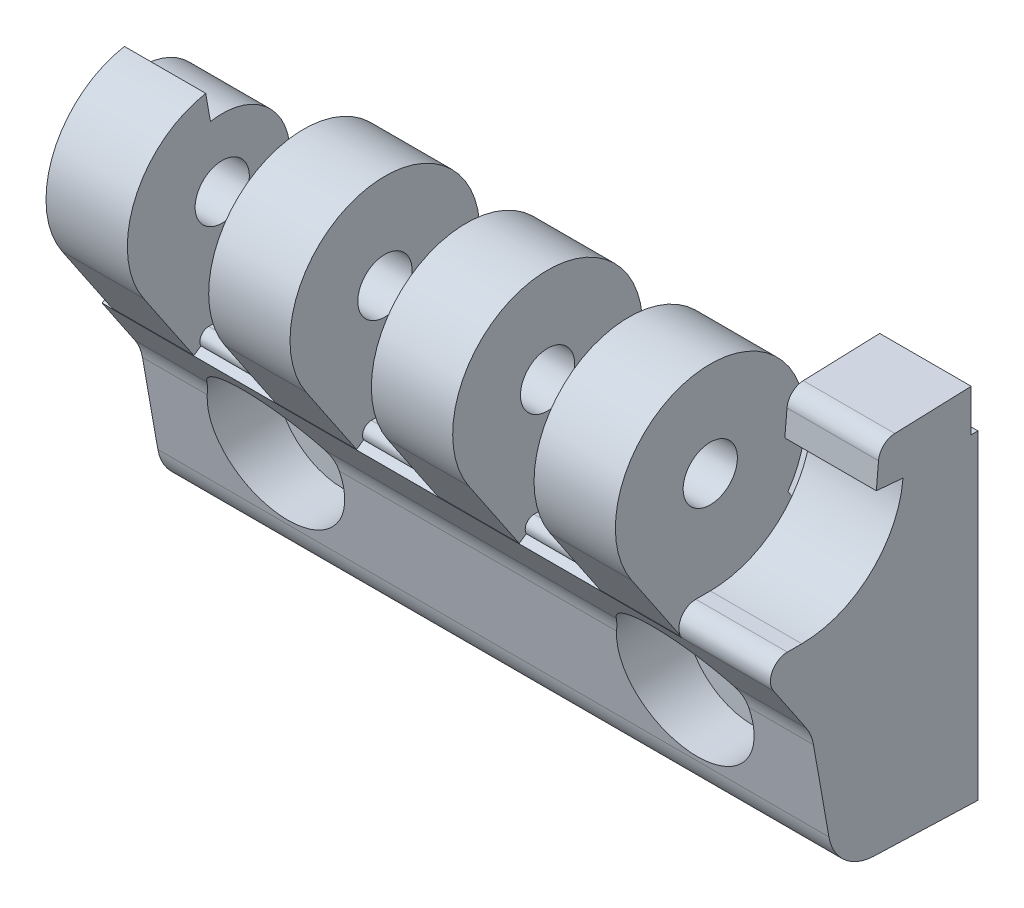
ISO-10303-21;
HEADER;
FILE_DESCRIPTION(('STEP AP214'),'2;1');
FILE_NAME('part.step','',(''),(''),'','','');
FILE_SCHEMA(('AUTOMOTIVE_DESIGN { 1 0 10303 214 1 1 1 1 }'));
ENDSEC;
DATA;
#1=APPLICATION_CONTEXT('core data for automotive mechanical design processes');
#2=APPLICATION_PROTOCOL_DEFINITION('international standard','automotive_design',2000,#1);
#3=PRODUCT_CONTEXT('',#1,'mechanical');
#4=PRODUCT('Part','Part','',(#3));
#5=PRODUCT_RELATED_PRODUCT_CATEGORY('part','',(#4));
#6=PRODUCT_DEFINITION_FORMATION('','',#4);
#7=PRODUCT_DEFINITION_CONTEXT('part definition',#1,'design');
#8=PRODUCT_DEFINITION('design','',#6,#7);
#9=PRODUCT_DEFINITION_SHAPE('','',#8);
#10=(LENGTH_UNIT() NAMED_UNIT(*) SI_UNIT(.MILLI.,.METRE.));
#11=(NAMED_UNIT(*) PLANE_ANGLE_UNIT() SI_UNIT($,.RADIAN.));
#12=(NAMED_UNIT(*) SI_UNIT($,.STERADIAN.) SOLID_ANGLE_UNIT());
#13=UNCERTAINTY_MEASURE_WITH_UNIT(LENGTH_MEASURE(1.E-05),#10,'distance_accuracy_value','');
#14=(GEOMETRIC_REPRESENTATION_CONTEXT(3) GLOBAL_UNCERTAINTY_ASSIGNED_CONTEXT((#13)) GLOBAL_UNIT_ASSIGNED_CONTEXT((#10,
#11,#12)) REPRESENTATION_CONTEXT('',''));
#15=CARTESIAN_POINT('',(0.,0.,0.));
#16=DIRECTION('',(0.,0.,1.));
#17=DIRECTION('',(1.,0.,0.));
#18=AXIS2_PLACEMENT_3D('',#15,#16,#17);
#19=CARTESIAN_POINT('',(-9.65,0.509585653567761,15.582626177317));
#20=DIRECTION('',(1.,0.,0.));
#21=DIRECTION('',(0.,1.,0.));
#22=AXIS2_PLACEMENT_3D('',#19,#20,#21);
#23=CYLINDRICAL_SURFACE('',#22,3.49999999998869);
#24=CARTESIAN_POINT('',(-2.987176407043,4.00958565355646,15.582626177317));
#25=CARTESIAN_POINT('',(-2.98717758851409,4.00958514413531,15.5176074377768));
#26=CARTESIAN_POINT('',(-2.98962124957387,4.00776828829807,15.4525729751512));
#27=CARTESIAN_POINT('',(-2.99927077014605,4.00055066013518,15.3230446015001));
#28=CARTESIAN_POINT('',(-3.00647939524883,3.99514780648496,15.2585510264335));
#29=CARTESIAN_POINT('',(-3.03485002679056,3.97369852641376,15.0663775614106));
#30=CARTESIAN_POINT('',(-3.06275515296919,3.95241198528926,14.9402262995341));
#31=CARTESIAN_POINT('',(-3.14399309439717,3.88828016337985,14.6538252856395));
#32=CARTESIAN_POINT('',(-3.20270634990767,3.84060828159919,14.49626383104));
#33=CARTESIAN_POINT('',(-3.33468021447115,3.72659575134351,14.1944647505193));
#34=CARTESIAN_POINT('',(-3.40797889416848,3.66020605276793,14.0502634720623));
#35=CARTESIAN_POINT('',(-3.53927086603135,3.53261432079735,13.8152666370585));
#36=CARTESIAN_POINT('',(-3.59549057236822,3.47554961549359,13.7211639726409));
#37=CARTESIAN_POINT('',(-3.70968873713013,3.35338553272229,13.5393932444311));
#38=CARTESIAN_POINT('',(-3.7676678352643,3.28828320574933,13.4517275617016));
#39=CARTESIAN_POINT('',(-3.88384832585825,3.15021820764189,13.282852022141));
#40=CARTESIAN_POINT('',(-3.94204985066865,3.07724977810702,13.2016469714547));
#41=CARTESIAN_POINT('',(-4.05730901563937,2.92360497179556,13.0460012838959));
#42=CARTESIAN_POINT('',(-4.11436675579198,2.8429292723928,12.9715600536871));
#43=CARTESIAN_POINT('',(-4.22656372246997,2.67330851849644,12.8293289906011));
#44=CARTESIAN_POINT('',(-4.28168470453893,2.58430435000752,12.76159503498));
#45=CARTESIAN_POINT('',(-4.3883500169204,2.39871661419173,12.6340909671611));
#46=CARTESIAN_POINT('',(-4.43989383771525,2.30213197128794,12.574321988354));
#47=CARTESIAN_POINT('',(-4.53807400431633,2.10196766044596,12.4637564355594));
#48=CARTESIAN_POINT('',(-4.58472305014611,1.99840730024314,12.4129363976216));
#49=CARTESIAN_POINT('',(-4.67205905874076,1.7847111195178,12.3210955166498));
#50=CARTESIAN_POINT('',(-4.71274931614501,1.67457898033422,12.2800692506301));
#51=CARTESIAN_POINT('',(-4.80057961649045,1.40736875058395,12.1958796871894));
#52=CARTESIAN_POINT('',(-4.84469315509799,1.24776995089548,12.1573538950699));
#53=CARTESIAN_POINT('',(-4.91721581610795,0.921361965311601,12.1030023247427));
#54=CARTESIAN_POINT('',(-4.94563650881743,0.754558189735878,12.0871598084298));
#55=CARTESIAN_POINT('',(-4.98540053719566,0.417833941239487,12.0797696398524));
#56=CARTESIAN_POINT('',(-4.99669274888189,0.247905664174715,12.088294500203));
#57=CARTESIAN_POINT('',(-5.00204729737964,-0.0891684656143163,12.1300410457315));
#58=CARTESIAN_POINT('',(-4.99610703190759,-0.25631389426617,12.1632664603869));
#59=CARTESIAN_POINT('',(-4.96922059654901,-0.575726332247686,12.2512032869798));
#60=CARTESIAN_POINT('',(-4.9489293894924,-0.728324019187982,12.3049313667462));
#61=CARTESIAN_POINT('',(-4.89653002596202,-1.02294092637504,12.4318932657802));
#62=CARTESIAN_POINT('',(-4.86441968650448,-1.1649581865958,12.505130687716));
#63=CARTESIAN_POINT('',(-4.7881204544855,-1.44820602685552,12.6762816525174));
#64=CARTESIAN_POINT('',(-4.74310806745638,-1.58822994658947,12.7758164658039));
#65=CARTESIAN_POINT('',(-4.64683001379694,-1.85111052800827,12.9929858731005));
#66=CARTESIAN_POINT('',(-4.59555845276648,-1.97395077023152,13.1106375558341));
#67=CARTESIAN_POINT('',(-4.4831837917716,-2.21851886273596,13.3813417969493));
#68=CARTESIAN_POINT('',(-4.42178077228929,-2.33717403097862,13.5370561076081));
#69=CARTESIAN_POINT('',(-4.30397223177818,-2.54762222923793,13.8674560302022));
#70=CARTESIAN_POINT('',(-4.24756543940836,-2.63942210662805,14.0421367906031));
#71=CARTESIAN_POINT('',(-4.15586213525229,-2.78115008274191,14.3789053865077));
#72=CARTESIAN_POINT('',(-4.11863958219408,-2.83539737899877,14.5386381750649));
#73=CARTESIAN_POINT('',(-4.05868227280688,-2.92059142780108,14.8667262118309));
#74=CARTESIAN_POINT('',(-4.03592573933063,-2.95157321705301,15.0350680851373));
#75=CARTESIAN_POINT('',(-4.00858867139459,-2.9886109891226,15.3769437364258));
#76=CARTESIAN_POINT('',(-4.00410626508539,-2.99453240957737,15.5505005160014));
#77=CARTESIAN_POINT('',(-4.01445226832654,-2.98064282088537,15.896028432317));
#78=CARTESIAN_POINT('',(-4.02928747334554,-2.96082275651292,16.0679989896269));
#79=CARTESIAN_POINT('',(-4.07374260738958,-2.89929018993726,16.3917092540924));
#80=CARTESIAN_POINT('',(-4.10212170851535,-2.85940202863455,16.5439817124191));
#81=CARTESIAN_POINT('',(-4.16926312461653,-2.76057955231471,16.8397496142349));
#82=CARTESIAN_POINT('',(-4.20802955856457,-2.70163767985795,16.9832415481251));
#83=CARTESIAN_POINT('',(-4.29791191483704,-2.5566019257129,17.279526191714));
#84=CARTESIAN_POINT('',(-4.35000136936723,-2.46782822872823,17.4307072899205));
#85=CARTESIAN_POINT('',(-4.45681123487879,-2.26926494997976,17.7176869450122));
#86=CARTESIAN_POINT('',(-4.51153439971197,-2.15945299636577,17.8534688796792));
#87=CARTESIAN_POINT('',(-4.62726966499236,-1.90043920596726,18.1288305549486));
#88=CARTESIAN_POINT('',(-4.68782759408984,-1.747727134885,18.2653332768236));
#89=CARTESIAN_POINT('',(-4.79777973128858,-1.41822515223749,18.511045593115));
#90=CARTESIAN_POINT('',(-4.84718634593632,-1.24146235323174,18.6202855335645));
#91=CARTESIAN_POINT('',(-4.91969517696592,-0.905507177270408,18.7881469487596));
#92=CARTESIAN_POINT('',(-4.94608565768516,-0.749901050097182,18.852526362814));
#93=CARTESIAN_POINT('',(-4.98413059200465,-0.429423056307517,18.9585230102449));
#94=CARTESIAN_POINT('',(-4.99579709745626,-0.264558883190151,19.0001588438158));
#95=CARTESIAN_POINT('',(-5.00231674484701,0.0703431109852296,19.059126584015));
#96=CARTESIAN_POINT('',(-4.99711896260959,0.240395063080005,19.0763846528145));
#97=CARTESIAN_POINT('',(-4.96919110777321,0.57976564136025,19.0860381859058));
#98=CARTESIAN_POINT('',(-4.94645915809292,0.74908418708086,19.0784309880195));
#99=CARTESIAN_POINT('',(-4.88593530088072,1.07412059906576,19.040495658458));
#100=CARTESIAN_POINT('',(-4.84888458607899,1.23010578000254,19.0112292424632));
#101=CARTESIAN_POINT('',(-4.76172702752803,1.53325167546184,18.9332424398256));
#102=CARTESIAN_POINT('',(-4.71161694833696,1.6804101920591,18.8845172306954));
#103=CARTESIAN_POINT('',(-4.59561699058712,1.97685657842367,18.7646120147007));
#104=CARTESIAN_POINT('',(-4.52868879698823,2.12505316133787,18.6917564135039));
#105=CARTESIAN_POINT('',(-4.38561560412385,2.40652240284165,18.5284952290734));
#106=CARTESIAN_POINT('',(-4.30946537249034,2.5397865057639,18.4380796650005));
#107=CARTESIAN_POINT('',(-4.13582479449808,2.81539020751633,18.2226299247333));
#108=CARTESIAN_POINT('',(-4.03708498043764,2.9543497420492,18.0942847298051));
#109=CARTESIAN_POINT('',(-3.83740259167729,3.20945147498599,17.817838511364));
#110=CARTESIAN_POINT('',(-3.73645765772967,3.32556775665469,17.6697153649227));
#111=CARTESIAN_POINT('',(-3.55041538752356,3.52291485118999,17.3710402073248));
#112=CARTESIAN_POINT('',(-3.46477255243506,3.60653908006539,17.22241075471));
#113=CARTESIAN_POINT('',(-3.30551018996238,3.75303100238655,16.9092103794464));
#114=CARTESIAN_POINT('',(-3.23186830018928,3.81593752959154,16.7446700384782));
#115=CARTESIAN_POINT('',(-3.12668584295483,3.90217980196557,16.4521064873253));
#116=CARTESIAN_POINT('',(-3.08914896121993,3.93172975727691,16.328109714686));
#117=CARTESIAN_POINT('',(-3.03028178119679,3.97728832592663,16.0740793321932));
#118=CARTESIAN_POINT('',(-3.00889266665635,3.99334610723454,15.9440694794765));
#119=CARTESIAN_POINT('',(-2.99395630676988,4.00452642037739,15.7746511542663));
#120=CARTESIAN_POINT('',(-2.99142014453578,4.00642079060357,15.7363245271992));
#121=CARTESIAN_POINT('',(-2.98802966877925,4.00895068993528,15.6595425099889));
#122=CARTESIAN_POINT('',(-2.98717570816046,4.00958595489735,15.6210870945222));
#123=CARTESIAN_POINT('',(-2.987176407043,4.00958565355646,15.582626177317));
#124=B_SPLINE_CURVE_WITH_KNOTS('',3,(#24,#25,#26,#27,#28,#29,#30,#31,#32,#33,#34,#35,#36,#37,
#38,#39,#40,#41,#42,#43,#44,#45,#46,#47,#48,#49,#50,#51,#52,#53,#54,#55,#56,#57,#58,#59,#60,#61,
#62,#63,#64,#65,#66,#67,#68,#69,#70,#71,#72,#73,#74,#75,#76,#77,#78,#79,#80,#81,#82,#83,#84,#85,
#86,#87,#88,#89,#90,#91,#92,#93,#94,#95,#96,#97,#98,#99,#100,#101,#102,#103,#104,#105,#106,#107,
#108,#109,#110,#111,#112,#113,#114,#115,#116,#117,#118,#119,#120,#121,#122,#123),.UNSPECIFIED.,
.T.,.F.,(4,2,2,2,2,2,2,2,2,2,2,2,2,2,2,2,2,2,2,2,2,2,2,2,2,2,2,2,2,2,2,2,2,2,2,2,2,2,2,2,2,2,2,
2,2,2,2,2,2,4),(0.,0.195009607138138,0.390132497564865,0.781032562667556,1.30252645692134,
1.82539983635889,2.19572698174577,2.56619042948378,2.93692694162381,3.30763090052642,
3.68120106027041,4.05482432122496,4.42745286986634,4.79987460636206,5.307583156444,
5.81491687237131,6.323761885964,6.8326837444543,7.31976376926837,7.80693380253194,
8.33768061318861,8.86893115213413,9.48183172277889,10.0945758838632,10.610736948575,
11.1261191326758,11.6442651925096,12.1625935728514,12.6405723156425,13.1187408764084,
13.6653982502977,14.2126401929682,14.8502703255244,15.4871875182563,15.9963644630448,
16.5051243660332,17.0154219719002,17.5257742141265,18.0126403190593,18.4996271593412,
19.0322217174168,19.5651198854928,20.2029510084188,20.8415016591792,21.4123510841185,
21.9821243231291,22.3793930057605,22.7752076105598,22.8905385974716,23.0058937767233),.UNSPECIFIED.);
#125=CARTESIAN_POINT('',(-4.3491483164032,2.466760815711,12.680994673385));
#126=VERTEX_POINT('',#125);
#127=CARTESIAN_POINT('',(-4.87355305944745,1.117354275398,12.135799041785));
#128=VERTEX_POINT('',#127);
#129=EDGE_CURVE('E29',#126,#128,#124,.T.);
#130=ORIENTED_EDGE('',*,*,#129,.F.);
#131=DIRECTION('',(1.,0.,0.));
#132=VECTOR('',#131,1.);
#133=CARTESIAN_POINT('',(-9.65,2.466760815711,12.680994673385));
#134=LINE('',#133,#132);
#135=CARTESIAN_POINT('',(-9.65,2.466760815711,12.680994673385));
#136=VERTEX_POINT('',#135);
#137=EDGE_CURVE('E399',#136,#126,#134,.T.);
#138=ORIENTED_EDGE('',*,*,#137,.F.);
#139=CARTESIAN_POINT('',(-9.65,0.509585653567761,15.582626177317));
#140=DIRECTION('',(-1.,0.,0.));
#141=DIRECTION('',(0.,1.,0.));
#142=AXIS2_PLACEMENT_3D('',#139,#140,#141);
#143=CIRCLE('',#142,3.49999999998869);
#144=CARTESIAN_POINT('',(-9.65,1.117354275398,12.135799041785));
#145=VERTEX_POINT('',#144);
#146=EDGE_CURVE('E527',#136,#145,#143,.T.);
#147=ORIENTED_EDGE('',*,*,#146,.T.);
#148=DIRECTION('',(1.,0.,0.));
#149=VECTOR('',#148,1.);
#150=CARTESIAN_POINT('',(-9.65,1.117354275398,12.135799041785));
#151=LINE('',#150,#149);
#152=EDGE_CURVE('E391',#145,#128,#151,.T.);
#153=ORIENTED_EDGE('',*,*,#152,.T.);
#154=EDGE_LOOP('',(#130,#138,#147,#153));
#155=FACE_BOUND('',#154,.T.);
#156=ADVANCED_FACE('F15',(#155),#23,.F.);
#157=CARTESIAN_POINT('',(2.987176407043,4.00958565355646,15.582626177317));
#158=CARTESIAN_POINT('',(2.98717758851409,4.00958514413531,15.6476449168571));
#159=CARTESIAN_POINT('',(2.98962124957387,4.00776828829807,15.7126793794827));
#160=CARTESIAN_POINT('',(2.99927077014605,4.00055066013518,15.8422077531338));
#161=CARTESIAN_POINT('',(3.00647939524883,3.99514780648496,15.9067013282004));
#162=CARTESIAN_POINT('',(3.03485002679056,3.97369852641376,16.0988747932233));
#163=CARTESIAN_POINT('',(3.06275515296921,3.95241198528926,16.2250260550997));
#164=CARTESIAN_POINT('',(3.14399309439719,3.88828016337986,16.5114270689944));
#165=CARTESIAN_POINT('',(3.20270634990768,3.8406082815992,16.6689885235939));
#166=CARTESIAN_POINT('',(3.33468021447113,3.72659575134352,16.9707876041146));
#167=CARTESIAN_POINT('',(3.40797889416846,3.66020605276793,17.1149888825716));
#168=CARTESIAN_POINT('',(3.53927086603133,3.53261432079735,17.3499857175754));
#169=CARTESIAN_POINT('',(3.5954905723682,3.4755496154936,17.444088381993));
#170=CARTESIAN_POINT('',(3.70968873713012,3.3533855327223,17.6258591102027));
#171=CARTESIAN_POINT('',(3.76766783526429,3.28828320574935,17.7135247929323));
#172=CARTESIAN_POINT('',(3.88384832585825,3.1502182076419,17.8824003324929));
#173=CARTESIAN_POINT('',(3.94204985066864,3.07724977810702,17.9636053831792));
#174=CARTESIAN_POINT('',(4.05730901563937,2.92360497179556,18.119251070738));
#175=CARTESIAN_POINT('',(4.11436675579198,2.8429292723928,18.1936923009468));
#176=CARTESIAN_POINT('',(4.22656372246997,2.67330851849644,18.3359233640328));
#177=CARTESIAN_POINT('',(4.28168470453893,2.58430435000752,18.4036573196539));
#178=CARTESIAN_POINT('',(4.3883500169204,2.39871661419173,18.5311613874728));
#179=CARTESIAN_POINT('',(4.43989383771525,2.30213197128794,18.5909303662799));
#180=CARTESIAN_POINT('',(4.53807400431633,2.10196766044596,18.7014959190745));
#181=CARTESIAN_POINT('',(4.58472305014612,1.99840730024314,18.7523159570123));
#182=CARTESIAN_POINT('',(4.67205905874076,1.7847111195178,18.8441568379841));
#183=CARTESIAN_POINT('',(4.712749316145,1.67457898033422,18.8851831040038));
#184=CARTESIAN_POINT('',(4.80057961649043,1.40736875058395,18.9693726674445));
#185=CARTESIAN_POINT('',(4.84469315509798,1.24776995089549,19.007898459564));
#186=CARTESIAN_POINT('',(4.91721581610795,0.921361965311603,19.0622500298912));
#187=CARTESIAN_POINT('',(4.94563650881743,0.754558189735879,19.078092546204));
#188=CARTESIAN_POINT('',(4.98540053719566,0.417833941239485,19.0854827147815));
#189=CARTESIAN_POINT('',(4.9966927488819,0.247905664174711,19.0769578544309));
#190=CARTESIAN_POINT('',(5.00204729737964,-0.0891684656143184,19.0352113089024));
#191=CARTESIAN_POINT('',(4.99610703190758,-0.256313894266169,19.0019858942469));
#192=CARTESIAN_POINT('',(4.969220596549,-0.575726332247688,18.914049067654));
#193=CARTESIAN_POINT('',(4.9489293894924,-0.728324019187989,18.8603209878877));
#194=CARTESIAN_POINT('',(4.89653002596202,-1.02294092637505,18.7333590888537));
#195=CARTESIAN_POINT('',(4.86441968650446,-1.1649581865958,18.6601216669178));
#196=CARTESIAN_POINT('',(4.78812045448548,-1.44820602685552,18.4889707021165));
#197=CARTESIAN_POINT('',(4.74310806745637,-1.58822994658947,18.38943588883));
#198=CARTESIAN_POINT('',(4.64683001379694,-1.85111052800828,18.1722664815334));
#199=CARTESIAN_POINT('',(4.59555845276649,-1.97395077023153,18.0546147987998));
#200=CARTESIAN_POINT('',(4.48318379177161,-2.21851886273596,17.7839105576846));
#201=CARTESIAN_POINT('',(4.4217807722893,-2.33717403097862,17.6281962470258));
#202=CARTESIAN_POINT('',(4.30397223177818,-2.54762222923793,17.2977963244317));
#203=CARTESIAN_POINT('',(4.24756543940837,-2.63942210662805,17.1231155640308));
#204=CARTESIAN_POINT('',(4.1558621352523,-2.78115008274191,16.7863469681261));
#205=CARTESIAN_POINT('',(4.11863958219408,-2.83539737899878,16.626614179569));
#206=CARTESIAN_POINT('',(4.05868227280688,-2.92059142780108,16.298526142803));
#207=CARTESIAN_POINT('',(4.03592573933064,-2.95157321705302,16.1301842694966));
#208=CARTESIAN_POINT('',(4.00858867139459,-2.98861098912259,15.7883086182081));
#209=CARTESIAN_POINT('',(4.0041062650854,-2.99453240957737,15.6147518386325));
#210=CARTESIAN_POINT('',(4.01445226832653,-2.98064282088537,15.2692239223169));
#211=CARTESIAN_POINT('',(4.02928747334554,-2.96082275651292,15.097253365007));
#212=CARTESIAN_POINT('',(4.07374260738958,-2.89929018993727,14.7735431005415));
#213=CARTESIAN_POINT('',(4.10212170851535,-2.85940202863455,14.6212706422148));
#214=CARTESIAN_POINT('',(4.16926312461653,-2.76057955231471,14.325502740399));
#215=CARTESIAN_POINT('',(4.20802955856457,-2.70163767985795,14.1820108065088));
#216=CARTESIAN_POINT('',(4.29791191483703,-2.5566019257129,13.8857261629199));
#217=CARTESIAN_POINT('',(4.35000136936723,-2.46782822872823,13.7345450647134));
#218=CARTESIAN_POINT('',(4.45681123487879,-2.26926494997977,13.4475654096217));
#219=CARTESIAN_POINT('',(4.51153439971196,-2.15945299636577,13.3117834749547));
#220=CARTESIAN_POINT('',(4.62726966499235,-1.90043920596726,13.0364217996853));
#221=CARTESIAN_POINT('',(4.68782759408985,-1.747727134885,12.8999190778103));
#222=CARTESIAN_POINT('',(4.79777973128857,-1.41822515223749,12.6542067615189));
#223=CARTESIAN_POINT('',(4.84718634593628,-1.24146235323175,12.5449668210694));
#224=CARTESIAN_POINT('',(4.91969517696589,-0.905507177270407,12.3771054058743));
#225=CARTESIAN_POINT('',(4.94608565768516,-0.749901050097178,12.3127259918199));
#226=CARTESIAN_POINT('',(4.98413059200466,-0.429423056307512,12.206729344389));
#227=CARTESIAN_POINT('',(4.99579709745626,-0.264558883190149,12.1650935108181));
#228=CARTESIAN_POINT('',(5.002316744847,0.0703431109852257,12.1061257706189));
#229=CARTESIAN_POINT('',(4.99711896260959,0.240395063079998,12.0888677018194));
#230=CARTESIAN_POINT('',(4.96919110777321,0.579765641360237,12.0792141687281));
#231=CARTESIAN_POINT('',(4.94645915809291,0.749084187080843,12.0868213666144));
#232=CARTESIAN_POINT('',(4.88593530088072,1.07412059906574,12.1247566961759));
#233=CARTESIAN_POINT('',(4.84888458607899,1.23010578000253,12.1540231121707));
#234=CARTESIAN_POINT('',(4.76172702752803,1.53325167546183,12.2320099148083));
#235=CARTESIAN_POINT('',(4.71161694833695,1.68041019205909,12.2807351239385));
#236=CARTESIAN_POINT('',(4.59561699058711,1.97685657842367,12.4006403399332));
#237=CARTESIAN_POINT('',(4.52868879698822,2.12505316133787,12.47349594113));
#238=CARTESIAN_POINT('',(4.38561560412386,2.40652240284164,12.6367571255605));
#239=CARTESIAN_POINT('',(4.30946537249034,2.5397865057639,12.7271726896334));
#240=CARTESIAN_POINT('',(4.13582479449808,2.81539020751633,12.9426224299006));
#241=CARTESIAN_POINT('',(4.03708498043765,2.95434974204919,13.0709676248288));
#242=CARTESIAN_POINT('',(3.83740259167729,3.20945147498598,13.3474138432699));
#243=CARTESIAN_POINT('',(3.73645765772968,3.32556775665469,13.4955369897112));
#244=CARTESIAN_POINT('',(3.55041538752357,3.52291485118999,13.7942121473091));
#245=CARTESIAN_POINT('',(3.46477255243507,3.60653908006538,13.9428415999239));
#246=CARTESIAN_POINT('',(3.3055101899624,3.75303100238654,14.2560419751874));
#247=CARTESIAN_POINT('',(3.2318683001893,3.81593752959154,14.4205823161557));
#248=CARTESIAN_POINT('',(3.12668584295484,3.90217980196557,14.7131458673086));
#249=CARTESIAN_POINT('',(3.08914896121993,3.9317297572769,14.8371426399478));
#250=CARTESIAN_POINT('',(3.03028178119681,3.97728832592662,15.0911730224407));
#251=CARTESIAN_POINT('',(3.0088926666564,3.99334610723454,15.2211828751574));
#252=CARTESIAN_POINT('',(2.99395630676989,4.00452642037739,15.3906012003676));
#253=CARTESIAN_POINT('',(2.99142014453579,4.00642079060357,15.4289278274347));
#254=CARTESIAN_POINT('',(2.98802966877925,4.00895068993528,15.505709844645));
#255=CARTESIAN_POINT('',(2.98717570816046,4.00958595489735,15.5441652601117));
#256=CARTESIAN_POINT('',(2.987176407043,4.00958565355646,15.582626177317));
#257=B_SPLINE_CURVE_WITH_KNOTS('',3,(#157,#158,#159,#160,#161,#162,#163,#164,#165,#166,#167,
#168,#169,#170,#171,#172,#173,#174,#175,#176,#177,#178,#179,#180,#181,#182,#183,#184,#185,#186,
#187,#188,#189,#190,#191,#192,#193,#194,#195,#196,#197,#198,#199,#200,#201,#202,#203,#204,#205,
#206,#207,#208,#209,#210,#211,#212,#213,#214,#215,#216,#217,#218,#219,#220,#221,#222,#223,#224,
#225,#226,#227,#228,#229,#230,#231,#232,#233,#234,#235,#236,#237,#238,#239,#240,#241,#242,#243,
#244,#245,#246,#247,#248,#249,#250,#251,#252,#253,#254,#255,#256),.UNSPECIFIED.,.T.,.F.,(4,2,2,
2,2,2,2,2,2,2,2,2,2,2,2,2,2,2,2,2,2,2,2,2,2,2,2,2,2,2,2,2,2,2,2,2,2,2,2,2,2,2,2,2,2,2,2,2,2,4),
(0.,0.195009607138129,0.390132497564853,0.781032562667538,1.30252645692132,1.82539983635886,
2.19572698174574,2.56619042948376,2.9369269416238,3.30763090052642,3.68120106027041,
4.05482432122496,4.42745286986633,4.79987460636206,5.30758315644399,5.81491687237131,
6.323761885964,6.8326837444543,7.31976376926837,7.80693380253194,8.3376806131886,
8.86893115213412,9.48183172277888,10.0945758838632,10.610736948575,11.1261191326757,
11.6442651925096,12.1625935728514,12.6405723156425,13.1187408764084,13.6653982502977,
14.2126401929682,14.8502703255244,15.4871875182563,15.9963644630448,16.5051243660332,
17.0154219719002,17.5257742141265,18.0126403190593,18.4996271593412,19.0322217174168,
19.5651198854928,20.2029510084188,20.8415016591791,21.4123510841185,21.982124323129,
22.3793930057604,22.7752076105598,22.8905385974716,23.0058937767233),.UNSPECIFIED.);
#258=CARTESIAN_POINT('',(4.87355305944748,1.117354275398,12.135799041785));
#259=VERTEX_POINT('',#258);
#260=CARTESIAN_POINT('',(4.3491483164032,2.466760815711,12.680994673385));
#261=VERTEX_POINT('',#260);
#262=EDGE_CURVE('E379',#259,#261,#257,.T.);
#263=ORIENTED_EDGE('',*,*,#262,.F.);
#264=CARTESIAN_POINT('',(25.3264469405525,1.117354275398,12.135799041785));
#265=VERTEX_POINT('',#264);
#266=EDGE_CURVE('E37',#259,#265,#151,.T.);
#267=ORIENTED_EDGE('',*,*,#266,.T.);
#268=CARTESIAN_POINT('',(27.212823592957,4.00958565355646,15.582626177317));
#269=CARTESIAN_POINT('',(27.2128224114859,4.00958514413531,15.5176074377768));
#270=CARTESIAN_POINT('',(27.2103787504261,4.00776828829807,15.4525729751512));
#271=CARTESIAN_POINT('',(27.2007292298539,4.00055066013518,15.3230446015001));
#272=CARTESIAN_POINT('',(27.1935206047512,3.99514780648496,15.2585510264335));
#273=CARTESIAN_POINT('',(27.1651499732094,3.97369852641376,15.0663775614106));
#274=CARTESIAN_POINT('',(27.1372448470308,3.95241198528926,14.9402262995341));
#275=CARTESIAN_POINT('',(27.0560069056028,3.88828016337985,14.6538252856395));
#276=CARTESIAN_POINT('',(26.9972936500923,3.84060828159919,14.49626383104));
#277=CARTESIAN_POINT('',(26.8653197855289,3.72659575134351,14.1944647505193));
#278=CARTESIAN_POINT('',(26.7920211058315,3.66020605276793,14.0502634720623));
#279=CARTESIAN_POINT('',(26.6607291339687,3.53261432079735,13.8152666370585));
#280=CARTESIAN_POINT('',(26.6045094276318,3.47554961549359,13.7211639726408));
#281=CARTESIAN_POINT('',(26.4903112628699,3.35338553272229,13.5393932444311));
#282=CARTESIAN_POINT('',(26.4323321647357,3.28828320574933,13.4517275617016));
#283=CARTESIAN_POINT('',(26.3161516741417,3.15021820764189,13.282852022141));
#284=CARTESIAN_POINT('',(26.2579501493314,3.07724977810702,13.2016469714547));
#285=CARTESIAN_POINT('',(26.1426909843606,2.92360497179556,13.0460012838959));
#286=CARTESIAN_POINT('',(26.085633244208,2.8429292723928,12.9715600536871));
#287=CARTESIAN_POINT('',(25.97343627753,2.67330851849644,12.8293289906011));
#288=CARTESIAN_POINT('',(25.9183152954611,2.58430435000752,12.76159503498));
#289=CARTESIAN_POINT('',(25.8116499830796,2.39871661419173,12.6340909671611));
#290=CARTESIAN_POINT('',(25.7601061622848,2.30213197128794,12.574321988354));
#291=CARTESIAN_POINT('',(25.6619259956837,2.10196766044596,12.4637564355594));
#292=CARTESIAN_POINT('',(25.6152769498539,1.99840730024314,12.4129363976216));
#293=CARTESIAN_POINT('',(25.5279409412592,1.7847111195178,12.3210955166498));
#294=CARTESIAN_POINT('',(25.487250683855,1.67457898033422,12.2800692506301));
#295=CARTESIAN_POINT('',(25.3994203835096,1.40736875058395,12.1958796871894));
#296=CARTESIAN_POINT('',(25.355306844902,1.24776995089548,12.1573538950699));
#297=CARTESIAN_POINT('',(25.2827841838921,0.921361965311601,12.1030023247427));
#298=CARTESIAN_POINT('',(25.2543634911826,0.754558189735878,12.0871598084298));
#299=CARTESIAN_POINT('',(25.2145994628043,0.417833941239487,12.0797696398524));
#300=CARTESIAN_POINT('',(25.2033072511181,0.247905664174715,12.088294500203));
#301=CARTESIAN_POINT('',(25.1979527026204,-0.0891684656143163,12.1300410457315));
#302=CARTESIAN_POINT('',(25.2038929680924,-0.25631389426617,12.1632664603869));
#303=CARTESIAN_POINT('',(25.230779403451,-0.575726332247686,12.2512032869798));
#304=CARTESIAN_POINT('',(25.2510706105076,-0.728324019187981,12.3049313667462));
#305=CARTESIAN_POINT('',(25.303469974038,-1.02294092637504,12.4318932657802));
#306=CARTESIAN_POINT('',(25.3355803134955,-1.1649581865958,12.505130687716));
#307=CARTESIAN_POINT('',(25.4118795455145,-1.44820602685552,12.6762816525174));
#308=CARTESIAN_POINT('',(25.4568919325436,-1.58822994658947,12.7758164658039));
#309=CARTESIAN_POINT('',(25.5531699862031,-1.85111052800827,12.9929858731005));
#310=CARTESIAN_POINT('',(25.6044415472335,-1.97395077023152,13.1106375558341));
#311=CARTESIAN_POINT('',(25.7168162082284,-2.21851886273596,13.3813417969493));
#312=CARTESIAN_POINT('',(25.7782192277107,-2.33717403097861,13.5370561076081));
#313=CARTESIAN_POINT('',(25.8960277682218,-2.54762222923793,13.8674560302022));
#314=CARTESIAN_POINT('',(25.9524345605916,-2.63942210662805,14.0421367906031));
#315=CARTESIAN_POINT('',(26.0441378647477,-2.78115008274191,14.3789053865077));
#316=CARTESIAN_POINT('',(26.0813604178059,-2.83539737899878,14.5386381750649));
#317=CARTESIAN_POINT('',(26.1413177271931,-2.92059142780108,14.8667262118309));
#318=CARTESIAN_POINT('',(26.1640742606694,-2.95157321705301,15.0350680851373));
#319=CARTESIAN_POINT('',(26.1914113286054,-2.9886109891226,15.3769437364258));
#320=CARTESIAN_POINT('',(26.1958937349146,-2.99453240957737,15.5505005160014));
#321=CARTESIAN_POINT('',(26.1855477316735,-2.98064282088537,15.896028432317));
#322=CARTESIAN_POINT('',(26.1707125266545,-2.96082275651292,16.0679989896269));
#323=CARTESIAN_POINT('',(26.1262573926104,-2.89929018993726,16.3917092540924));
#324=CARTESIAN_POINT('',(26.0978782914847,-2.85940202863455,16.5439817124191));
#325=CARTESIAN_POINT('',(26.0307368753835,-2.76057955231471,16.8397496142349));
#326=CARTESIAN_POINT('',(25.9919704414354,-2.70163767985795,16.9832415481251));
#327=CARTESIAN_POINT('',(25.902088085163,-2.5566019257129,17.279526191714));
#328=CARTESIAN_POINT('',(25.8499986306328,-2.46782822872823,17.4307072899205));
#329=CARTESIAN_POINT('',(25.7431887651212,-2.26926494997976,17.7176869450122));
#330=CARTESIAN_POINT('',(25.688465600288,-2.15945299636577,17.8534688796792));
#331=CARTESIAN_POINT('',(25.5727303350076,-1.90043920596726,18.1288305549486));
#332=CARTESIAN_POINT('',(25.5121724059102,-1.747727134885,18.2653332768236));
#333=CARTESIAN_POINT('',(25.4022202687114,-1.41822515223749,18.511045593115));
#334=CARTESIAN_POINT('',(25.3528136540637,-1.24146235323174,18.6202855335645));
#335=CARTESIAN_POINT('',(25.2803048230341,-0.905507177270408,18.7881469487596));
#336=CARTESIAN_POINT('',(25.2539143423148,-0.749901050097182,18.852526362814));
#337=CARTESIAN_POINT('',(25.2158694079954,-0.429423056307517,18.9585230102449));
#338=CARTESIAN_POINT('',(25.2042029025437,-0.264558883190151,19.0001588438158));
#339=CARTESIAN_POINT('',(25.197683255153,0.0703431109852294,19.059126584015));
#340=CARTESIAN_POINT('',(25.2028810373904,0.240395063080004,19.0763846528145));
#341=CARTESIAN_POINT('',(25.2308088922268,0.57976564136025,19.0860381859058));
#342=CARTESIAN_POINT('',(25.2535408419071,0.749084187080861,19.0784309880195));
#343=CARTESIAN_POINT('',(25.3140646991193,1.07412059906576,19.040495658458));
#344=CARTESIAN_POINT('',(25.351115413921,1.23010578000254,19.0112292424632));
#345=CARTESIAN_POINT('',(25.438272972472,1.53325167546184,18.9332424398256));
#346=CARTESIAN_POINT('',(25.488383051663,1.6804101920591,18.8845172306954));
#347=CARTESIAN_POINT('',(25.6043830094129,1.97685657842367,18.7646120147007));
#348=CARTESIAN_POINT('',(25.6713112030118,2.12505316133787,18.6917564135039));
#349=CARTESIAN_POINT('',(25.8143843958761,2.40652240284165,18.5284952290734));
#350=CARTESIAN_POINT('',(25.8905346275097,2.5397865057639,18.4380796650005));
#351=CARTESIAN_POINT('',(26.0641752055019,2.81539020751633,18.2226299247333));
#352=CARTESIAN_POINT('',(26.1629150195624,2.9543497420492,18.0942847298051));
#353=CARTESIAN_POINT('',(26.3625974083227,3.20945147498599,17.817838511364));
#354=CARTESIAN_POINT('',(26.4635423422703,3.32556775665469,17.6697153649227));
#355=CARTESIAN_POINT('',(26.6495846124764,3.52291485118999,17.3710402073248));
#356=CARTESIAN_POINT('',(26.7352274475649,3.60653908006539,17.22241075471));
#357=CARTESIAN_POINT('',(26.8944898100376,3.75303100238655,16.9092103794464));
#358=CARTESIAN_POINT('',(26.9681316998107,3.81593752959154,16.7446700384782));
#359=CARTESIAN_POINT('',(27.0733141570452,3.90217980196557,16.4521064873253));
#360=CARTESIAN_POINT('',(27.1108510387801,3.93172975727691,16.328109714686));
#361=CARTESIAN_POINT('',(27.1697182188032,3.97728832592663,16.0740793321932));
#362=CARTESIAN_POINT('',(27.1911073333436,3.99334610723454,15.9440694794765));
#363=CARTESIAN_POINT('',(27.2060436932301,4.00452642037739,15.7746511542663));
#364=CARTESIAN_POINT('',(27.2085798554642,4.00642079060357,15.7363245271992));
#365=CARTESIAN_POINT('',(27.2119703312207,4.00895068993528,15.6595425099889));
#366=CARTESIAN_POINT('',(27.2128242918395,4.00958595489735,15.6210870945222));
#367=CARTESIAN_POINT('',(27.212823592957,4.00958565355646,15.582626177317));
#368=B_SPLINE_CURVE_WITH_KNOTS('',3,(#268,#269,#270,#271,#272,#273,#274,#275,#276,#277,#278,
#279,#280,#281,#282,#283,#284,#285,#286,#287,#288,#289,#290,#291,#292,#293,#294,#295,#296,#297,
#298,#299,#300,#301,#302,#303,#304,#305,#306,#307,#308,#309,#310,#311,#312,#313,#314,#315,#316,
#317,#318,#319,#320,#321,#322,#323,#324,#325,#326,#327,#328,#329,#330,#331,#332,#333,#334,#335,
#336,#337,#338,#339,#340,#341,#342,#343,#344,#345,#346,#347,#348,#349,#350,#351,#352,#353,#354,
#355,#356,#357,#358,#359,#360,#361,#362,#363,#364,#365,#366,#367),.UNSPECIFIED.,.T.,.F.,(4,2,2,
2,2,2,2,2,2,2,2,2,2,2,2,2,2,2,2,2,2,2,2,2,2,2,2,2,2,2,2,2,2,2,2,2,2,2,2,2,2,2,2,2,2,2,2,2,2,4),
(0.,0.195009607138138,0.390132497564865,0.781032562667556,1.30252645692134,1.82539983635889,
2.19572698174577,2.56619042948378,2.93692694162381,3.30763090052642,3.68120106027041,
4.05482432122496,4.42745286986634,4.79987460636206,5.307583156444,5.81491687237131,
6.323761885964,6.8326837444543,7.31976376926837,7.80693380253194,8.33768061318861,
8.86893115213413,9.48183172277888,10.0945758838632,10.610736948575,11.1261191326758,
11.6442651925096,12.1625935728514,12.6405723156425,13.1187408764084,13.6653982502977,
14.2126401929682,14.8502703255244,15.4871875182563,15.9963644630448,16.5051243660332,
17.0154219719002,17.5257742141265,18.0126403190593,18.4996271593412,19.0322217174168,
19.5651198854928,20.2029510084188,20.8415016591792,21.4123510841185,21.9821243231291,
22.3793930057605,22.7752076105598,22.8905385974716,23.0058937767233),.UNSPECIFIED.);
#369=CARTESIAN_POINT('',(25.8508516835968,2.466760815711,12.680994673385));
#370=VERTEX_POINT('',#369);
#371=EDGE_CURVE('E490',#370,#265,#368,.T.);
#372=ORIENTED_EDGE('',*,*,#371,.F.);
#373=EDGE_CURVE('E385',#261,#370,#134,.T.);
#374=ORIENTED_EDGE('',*,*,#373,.F.);
#375=EDGE_LOOP('',(#263,#267,#372,#374));
#376=FACE_BOUND('',#375,.T.);
#377=ADVANCED_FACE('F384',(#376),#23,.F.);
#378=CARTESIAN_POINT('',(-30.9,6.75000000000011,14.0000000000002));
#379=DIRECTION('',(1.,0.,0.));
#380=DIRECTION('',(0.,1.,0.));
#381=AXIS2_PLACEMENT_3D('',#378,#379,#380);
#382=CYLINDRICAL_SURFACE('',#381,0.649999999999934);
#383=CARTESIAN_POINT('',(15.1,6.75000000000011,14.0000000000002));
#384=DIRECTION('',(1.,0.,0.));
#385=DIRECTION('',(0.,1.,0.));
#386=AXIS2_PLACEMENT_3D('',#383,#384,#385);
#387=CIRCLE('',#386,0.649999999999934);
#388=CARTESIAN_POINT('',(15.1,7.3999993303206,14.000933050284));
#389=VERTEX_POINT('',#388);
#390=CARTESIAN_POINT('',(15.1,6.4375900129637,14.57));
#391=VERTEX_POINT('',#390);
#392=EDGE_CURVE('E1155',#389,#391,#387,.T.);
#393=ORIENTED_EDGE('',*,*,#392,.F.);
#394=DIRECTION('',(1.,0.,0.));
#395=VECTOR('',#394,1.);
#396=CARTESIAN_POINT('',(-30.9,7.3999993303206,14.000933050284));
#397=LINE('',#396,#395);
#398=CARTESIAN_POINT('',(9.1,7.3999993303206,14.000933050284));
#399=VERTEX_POINT('',#398);
#400=EDGE_CURVE('E2336',#399,#389,#397,.T.);
#401=ORIENTED_EDGE('',*,*,#400,.F.);
#402=CARTESIAN_POINT('',(9.1,6.75000000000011,14.0000000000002));
#403=DIRECTION('',(1.,0.,0.));
#404=DIRECTION('',(0.,1.,0.));
#405=AXIS2_PLACEMENT_3D('',#402,#403,#404);
#406=CIRCLE('',#405,0.649999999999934);
#407=CARTESIAN_POINT('',(9.1,6.4375900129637,14.57));
#408=VERTEX_POINT('',#407);
#409=EDGE_CURVE('E949',#399,#408,#406,.T.);
#410=ORIENTED_EDGE('',*,*,#409,.T.);
#411=DIRECTION('',(1.,0.,0.));
#412=VECTOR('',#411,1.);
#413=CARTESIAN_POINT('',(-30.9,6.4375900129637,14.57));
#414=LINE('',#413,#412);
#415=EDGE_CURVE('E1196',#408,#391,#414,.T.);
#416=ORIENTED_EDGE('',*,*,#415,.T.);
#417=EDGE_LOOP('',(#393,#401,#410,#416));
#418=FACE_BOUND('',#417,.T.);
#419=ADVANCED_FACE('F750',(#418),#382,.T.);
#420=CARTESIAN_POINT('',(-30.9,7.3999993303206,14.000933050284));
#421=DIRECTION('',(0.,-0.999998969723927,-0.00143546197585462));
#422=DIRECTION('',(0.,0.00143546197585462,-0.999998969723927));
#423=AXIS2_PLACEMENT_3D('',#420,#421,#422);
#424=PLANE('',#423);
#425=DIRECTION('',(0.,-0.00143546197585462,0.999998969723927));
#426=VECTOR('',#425,1.);
#427=CARTESIAN_POINT('',(15.1,7.3999993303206,14.000933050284));
#428=LINE('',#427,#426);
#429=CARTESIAN_POINT('',(15.1,7.4012332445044,13.141340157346));
#430=VERTEX_POINT('',#429);
#431=EDGE_CURVE('E1152',#430,#389,#428,.T.);
#432=ORIENTED_EDGE('',*,*,#431,.F.);
#433=DIRECTION('',(1.,0.,0.));
#434=VECTOR('',#433,1.);
#435=CARTESIAN_POINT('',(-30.9,7.4012332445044,13.141340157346));
#436=LINE('',#435,#434);
#437=CARTESIAN_POINT('',(9.1,7.4012332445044,13.141340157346));
#438=VERTEX_POINT('',#437);
#439=EDGE_CURVE('E1119',#438,#430,#436,.T.);
#440=ORIENTED_EDGE('',*,*,#439,.F.);
#441=DIRECTION('',(0.,-0.00143546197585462,0.999998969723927));
#442=VECTOR('',#441,1.);
#443=CARTESIAN_POINT('',(9.1,7.3999993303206,14.000933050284));
#444=LINE('',#443,#442);
#445=EDGE_CURVE('E952',#438,#399,#444,.T.);
#446=ORIENTED_EDGE('',*,*,#445,.T.);
#447=ORIENTED_EDGE('',*,*,#400,.T.);
#448=EDGE_LOOP('',(#432,#440,#446,#447));
#449=FACE_BOUND('',#448,.T.);
#450=ADVANCED_FACE('F745',(#449),#424,.F.);
#451=CARTESIAN_POINT('',(-30.9,15.4999999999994,12.9999999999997));
#452=DIRECTION('',(1.,0.,0.));
#453=DIRECTION('',(0.,1.,0.));
#454=AXIS2_PLACEMENT_3D('',#451,#452,#453);
#455=CYLINDRICAL_SURFACE('',#454,8.09999999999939);
#456=CARTESIAN_POINT('',(15.1,15.4999999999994,12.9999999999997));
#457=DIRECTION('',(1.,0.,0.));
#458=DIRECTION('',(0.,1.,0.));
#459=AXIS2_PLACEMENT_3D('',#456,#457,#458);
#460=CIRCLE('',#459,8.09999999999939);
#461=CARTESIAN_POINT('',(15.1,10.1084868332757,6.9550363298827));
#462=VERTEX_POINT('',#461);
#463=EDGE_CURVE('E1150',#462,#430,#460,.F.);
#464=ORIENTED_EDGE('',*,*,#463,.F.);
#465=DIRECTION('',(1.,0.,0.));
#466=VECTOR('',#465,1.);
#467=CARTESIAN_POINT('',(-30.9,10.1084868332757,6.9550363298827));
#468=LINE('',#467,#466);
#469=CARTESIAN_POINT('',(9.1,10.1084868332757,6.9550363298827));
#470=VERTEX_POINT('',#469);
#471=EDGE_CURVE('E784',#470,#462,#468,.T.);
#472=ORIENTED_EDGE('',*,*,#471,.F.);
#473=CARTESIAN_POINT('',(9.1,15.4999999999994,12.9999999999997));
#474=DIRECTION('',(1.,0.,0.));
#475=DIRECTION('',(0.,1.,0.));
#476=AXIS2_PLACEMENT_3D('',#473,#474,#475);
#477=CIRCLE('',#476,8.09999999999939);
#478=EDGE_CURVE('E955',#470,#438,#477,.F.);
#479=ORIENTED_EDGE('',*,*,#478,.T.);
#480=ORIENTED_EDGE('',*,*,#439,.T.);
#481=EDGE_LOOP('',(#464,#472,#479,#480));
#482=FACE_BOUND('',#481,.T.);
#483=ADVANCED_FACE('F740',(#482),#455,.F.);
#484=CARTESIAN_POINT('',(21.1,7.3999993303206,14.000933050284));
#485=VERTEX_POINT('',#484);
#486=CARTESIAN_POINT('',(27.1,7.3999993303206,14.000933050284));
#487=VERTEX_POINT('',#486);
#488=EDGE_CURVE('E798',#485,#487,#397,.T.);
#489=ORIENTED_EDGE('',*,*,#488,.F.);
#490=CARTESIAN_POINT('',(21.1,6.75000000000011,14.0000000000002));
#491=DIRECTION('',(1.,0.,0.));
#492=DIRECTION('',(0.,1.,0.));
#493=AXIS2_PLACEMENT_3D('',#490,#491,#492);
#494=CIRCLE('',#493,0.649999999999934);
#495=CARTESIAN_POINT('',(21.1,6.4375900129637,14.57));
#496=VERTEX_POINT('',#495);
#497=EDGE_CURVE('E1143',#485,#496,#494,.T.);
#498=ORIENTED_EDGE('',*,*,#497,.T.);
#499=CARTESIAN_POINT('',(27.1,6.4375900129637,14.57));
#500=VERTEX_POINT('',#499);
#501=EDGE_CURVE('E803',#496,#500,#414,.T.);
#502=ORIENTED_EDGE('',*,*,#501,.T.);
#503=CARTESIAN_POINT('',(27.1,6.75000000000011,14.0000000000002));
#504=DIRECTION('',(1.,0.,0.));
#505=DIRECTION('',(0.,1.,0.));
#506=AXIS2_PLACEMENT_3D('',#503,#504,#505);
#507=CIRCLE('',#506,0.649999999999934);
#508=EDGE_CURVE('E910',#487,#500,#507,.T.);
#509=ORIENTED_EDGE('',*,*,#508,.F.);
#510=EDGE_LOOP('',(#489,#498,#502,#509));
#511=FACE_BOUND('',#510,.T.);
#512=ADVANCED_FACE('F1217',(#511),#382,.T.);
#513=CARTESIAN_POINT('',(21.1,7.4012332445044,13.141340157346));
#514=VERTEX_POINT('',#513);
#515=CARTESIAN_POINT('',(27.1,7.4012332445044,13.141340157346));
#516=VERTEX_POINT('',#515);
#517=EDGE_CURVE('E793',#514,#516,#436,.T.);
#518=ORIENTED_EDGE('',*,*,#517,.F.);
#519=DIRECTION('',(0.,-0.00143546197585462,0.999998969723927));
#520=VECTOR('',#519,1.);
#521=CARTESIAN_POINT('',(21.1,7.3999993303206,14.000933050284));
#522=LINE('',#521,#520);
#523=EDGE_CURVE('E1141',#514,#485,#522,.T.);
#524=ORIENTED_EDGE('',*,*,#523,.T.);
#525=ORIENTED_EDGE('',*,*,#488,.T.);
#526=DIRECTION('',(0.,-0.00143546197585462,0.999998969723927));
#527=VECTOR('',#526,1.);
#528=CARTESIAN_POINT('',(27.1,7.3999993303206,14.000933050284));
#529=LINE('',#528,#527);
#530=EDGE_CURVE('E907',#516,#487,#529,.T.);
#531=ORIENTED_EDGE('',*,*,#530,.F.);
#532=EDGE_LOOP('',(#518,#524,#525,#531));
#533=FACE_BOUND('',#532,.T.);
#534=ADVANCED_FACE('F1134',(#533),#424,.F.);
#535=CARTESIAN_POINT('',(21.1,10.1084868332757,6.9550363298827));
#536=VERTEX_POINT('',#535);
#537=CARTESIAN_POINT('',(27.1,10.1084868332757,6.9550363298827));
#538=VERTEX_POINT('',#537);
#539=EDGE_CURVE('E782',#536,#538,#468,.T.);
#540=ORIENTED_EDGE('',*,*,#539,.F.);
#541=CARTESIAN_POINT('',(21.1,15.4999999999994,12.9999999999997));
#542=DIRECTION('',(1.,0.,0.));
#543=DIRECTION('',(0.,1.,0.));
#544=AXIS2_PLACEMENT_3D('',#541,#542,#543);
#545=CIRCLE('',#544,8.09999999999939);
#546=EDGE_CURVE('E1131',#536,#514,#545,.F.);
#547=ORIENTED_EDGE('',*,*,#546,.T.);
#548=ORIENTED_EDGE('',*,*,#517,.T.);
#549=CARTESIAN_POINT('',(27.1,15.4999999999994,12.9999999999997));
#550=DIRECTION('',(1.,0.,0.));
#551=DIRECTION('',(0.,1.,0.));
#552=AXIS2_PLACEMENT_3D('',#549,#550,#551);
#553=CIRCLE('',#552,8.09999999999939);
#554=EDGE_CURVE('E471',#538,#516,#553,.F.);
#555=ORIENTED_EDGE('',*,*,#554,.F.);
#556=EDGE_LOOP('',(#540,#547,#548,#555));
#557=FACE_BOUND('',#556,.T.);
#558=ADVANCED_FACE('F1129',(#557),#455,.F.);
#559=CARTESIAN_POINT('',(33.1,6.75000000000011,14.0000000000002));
#560=DIRECTION('',(-1.,0.,0.));
#561=DIRECTION('',(0.,-1.,0.));
#562=AXIS2_PLACEMENT_3D('',#559,#560,#561);
#563=PLANE('',#562);
#564=DIRECTION('',(0.,0.829037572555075,0.559192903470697));
#565=VECTOR('',#564,1.);
#566=CARTESIAN_POINT('',(33.1,6.03533775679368,15.0595303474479));
#567=LINE('',#566,#565);
#568=CARTESIAN_POINT('',(33.1,6.08486474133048,15.0929367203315));
#569=VERTEX_POINT('',#568);
#570=CARTESIAN_POINT('',(33.1,6.26475642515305,15.2142751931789));
#571=VERTEX_POINT('',#570);
#572=EDGE_CURVE('E467',#569,#571,#567,.T.);
#573=ORIENTED_EDGE('',*,*,#572,.F.);
#574=DIRECTION('',(0.,0.559192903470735,-0.82903757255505));
#575=VECTOR('',#574,1.);
#576=CARTESIAN_POINT('',(33.1,5.878397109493,15.399037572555));
#577=LINE('',#576,#575);
#578=CARTESIAN_POINT('',(33.1,6.07179113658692,15.112319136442));
#579=VERTEX_POINT('',#578);
#580=EDGE_CURVE('E1047',#579,#569,#577,.T.);
#581=ORIENTED_EDGE('',*,*,#580,.F.);
#582=CARTESIAN_POINT('',(33.1,6.75000000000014,14.0623035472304));
#583=DIRECTION('',(-1.,0.,0.));
#584=DIRECTION('',(0.,-1.,0.));
#585=AXIS2_PLACEMENT_3D('',#582,#583,#584);
#586=CIRCLE('',#585,1.24999999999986);
#587=EDGE_CURVE('E439',#571,#579,#586,.F.);
#588=ORIENTED_EDGE('',*,*,#587,.F.);
#589=EDGE_LOOP('',(#573,#581,#588));
#590=FACE_BOUND('',#589,.T.);
#591=ADVANCED_FACE('F729',(#590),#563,.T.);
#592=CARTESIAN_POINT('',(3.1,6.75000000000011,14.0000000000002));
#593=DIRECTION('',(1.,0.,0.));
#594=DIRECTION('',(0.,1.,0.));
#595=AXIS2_PLACEMENT_3D('',#592,#593,#594);
#596=CIRCLE('',#595,0.649999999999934);
#597=CARTESIAN_POINT('',(3.1,7.3999993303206,14.000933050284));
#598=VERTEX_POINT('',#597);
#599=CARTESIAN_POINT('',(3.1,6.4375900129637,14.57));
#600=VERTEX_POINT('',#599);
#601=EDGE_CURVE('E961',#598,#600,#596,.T.);
#602=ORIENTED_EDGE('',*,*,#601,.F.);
#603=CARTESIAN_POINT('',(-2.9,7.3999993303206,14.000933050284));
#604=VERTEX_POINT('',#603);
#605=EDGE_CURVE('E804',#604,#598,#397,.T.);
#606=ORIENTED_EDGE('',*,*,#605,.F.);
#607=CARTESIAN_POINT('',(-2.9,6.75000000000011,14.0000000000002));
#608=DIRECTION('',(-1.,0.,0.));
#609=DIRECTION('',(0.,-1.,0.));
#610=AXIS2_PLACEMENT_3D('',#607,#608,#609);
#611=CIRCLE('',#610,0.649999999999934);
#612=CARTESIAN_POINT('',(-2.9,6.4375900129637,14.57));
#613=VERTEX_POINT('',#612);
#614=EDGE_CURVE('E1027',#613,#604,#611,.T.);
#615=ORIENTED_EDGE('',*,*,#614,.F.);
#616=EDGE_CURVE('E809',#613,#600,#414,.T.);
#617=ORIENTED_EDGE('',*,*,#616,.T.);
#618=EDGE_LOOP('',(#602,#606,#615,#617));
#619=FACE_BOUND('',#618,.T.);
#620=ADVANCED_FACE('F751',(#619),#382,.T.);
#621=DIRECTION('',(0.,-0.00143546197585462,0.999998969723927));
#622=VECTOR('',#621,1.);
#623=CARTESIAN_POINT('',(3.1,7.3999993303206,14.000933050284));
#624=LINE('',#623,#622);
#625=CARTESIAN_POINT('',(3.1,7.4012332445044,13.141340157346));
#626=VERTEX_POINT('',#625);
#627=EDGE_CURVE('E963',#626,#598,#624,.T.);
#628=ORIENTED_EDGE('',*,*,#627,.F.);
#629=CARTESIAN_POINT('',(-2.9,7.4012332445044,13.141340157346));
#630=VERTEX_POINT('',#629);
#631=EDGE_CURVE('E799',#630,#626,#436,.T.);
#632=ORIENTED_EDGE('',*,*,#631,.F.);
#633=DIRECTION('',(0.,0.00143546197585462,-0.999998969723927));
#634=VECTOR('',#633,1.);
#635=CARTESIAN_POINT('',(-2.9,7.3999993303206,14.000933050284));
#636=LINE('',#635,#634);
#637=EDGE_CURVE('E1030',#604,#630,#636,.T.);
#638=ORIENTED_EDGE('',*,*,#637,.F.);
#639=ORIENTED_EDGE('',*,*,#605,.T.);
#640=EDGE_LOOP('',(#628,#632,#638,#639));
#641=FACE_BOUND('',#640,.T.);
#642=ADVANCED_FACE('F746',(#641),#424,.F.);
#643=CARTESIAN_POINT('',(3.1,15.4999999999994,12.9999999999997));
#644=DIRECTION('',(1.,0.,0.));
#645=DIRECTION('',(0.,1.,0.));
#646=AXIS2_PLACEMENT_3D('',#643,#644,#645);
#647=CIRCLE('',#646,8.09999999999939);
#648=CARTESIAN_POINT('',(3.1,10.1084868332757,6.9550363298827));
#649=VERTEX_POINT('',#648);
#650=EDGE_CURVE('E965',#649,#626,#647,.F.);
#651=ORIENTED_EDGE('',*,*,#650,.F.);
#652=CARTESIAN_POINT('',(-2.9,10.1084868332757,6.9550363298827));
#653=VERTEX_POINT('',#652);
#654=EDGE_CURVE('E794',#653,#649,#468,.T.);
#655=ORIENTED_EDGE('',*,*,#654,.F.);
#656=CARTESIAN_POINT('',(-2.9,15.4999999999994,12.9999999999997));
#657=DIRECTION('',(-1.,0.,0.));
#658=DIRECTION('',(0.,-1.,0.));
#659=AXIS2_PLACEMENT_3D('',#656,#657,#658);
#660=CIRCLE('',#659,8.09999999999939);
#661=EDGE_CURVE('E1033',#630,#653,#660,.F.);
#662=ORIENTED_EDGE('',*,*,#661,.F.);
#663=ORIENTED_EDGE('',*,*,#631,.T.);
#664=EDGE_LOOP('',(#651,#655,#662,#663));
#665=FACE_BOUND('',#664,.T.);
#666=ADVANCED_FACE('F734',(#665),#455,.F.);
#667=CARTESIAN_POINT('',(-30.9,10.1084868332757,6.9550363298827));
#668=DIRECTION('',(0.,-0.996194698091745,0.0871557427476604));
#669=DIRECTION('',(0.,-0.0871557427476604,-0.996194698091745));
#670=AXIS2_PLACEMENT_3D('',#667,#668,#669);
#671=PLANE('',#670);
#672=DIRECTION('',(-1.,0.,0.));
#673=VECTOR('',#672,1.);
#674=CARTESIAN_POINT('',(-30.9,10.0520319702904,6.3097542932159));
#675=LINE('',#674,#673);
#676=CARTESIAN_POINT('',(21.1,10.0520319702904,6.3097542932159));
#677=VERTEX_POINT('',#676);
#678=CARTESIAN_POINT('',(15.1,10.0520319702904,6.3097542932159));
#679=VERTEX_POINT('',#678);
#680=EDGE_CURVE('E482',#677,#679,#675,.T.);
#681=ORIENTED_EDGE('',*,*,#680,.F.);
#682=DIRECTION('',(0.,0.0871557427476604,0.996194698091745));
#683=VECTOR('',#682,1.);
#684=CARTESIAN_POINT('',(21.1,10.1084868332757,6.9550363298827));
#685=LINE('',#684,#683);
#686=EDGE_CURVE('E885',#677,#536,#685,.T.);
#687=ORIENTED_EDGE('',*,*,#686,.T.);
#688=ORIENTED_EDGE('',*,*,#539,.T.);
#689=DIRECTION('',(0.,0.0871557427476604,0.996194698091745));
#690=VECTOR('',#689,1.);
#691=CARTESIAN_POINT('',(27.1,10.1084868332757,6.9550363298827));
#692=LINE('',#691,#690);
#693=CARTESIAN_POINT('',(27.1,10.0520319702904,6.3097542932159));
#694=VERTEX_POINT('',#693);
#695=EDGE_CURVE('E916',#694,#538,#692,.T.);
#696=ORIENTED_EDGE('',*,*,#695,.F.);
#697=DIRECTION('',(1.,0.,0.));
#698=VECTOR('',#697,1.);
#699=CARTESIAN_POINT('',(-30.9,10.0520319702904,6.3097542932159));
#700=LINE('',#699,#698);
#701=CARTESIAN_POINT('',(33.1,10.0520319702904,6.3097542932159));
#702=VERTEX_POINT('',#701);
#703=EDGE_CURVE('E902',#694,#702,#700,.T.);
#704=ORIENTED_EDGE('',*,*,#703,.T.);
#705=DIRECTION('',(0.,-0.0871557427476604,-0.996194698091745));
#706=VECTOR('',#705,1.);
#707=CARTESIAN_POINT('',(33.1,10.1084868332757,6.9550363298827));
#708=LINE('',#707,#706);
#709=CARTESIAN_POINT('',(33.1,9.5,0.));
#710=VERTEX_POINT('',#709);
#711=EDGE_CURVE('E788',#702,#710,#708,.T.);
#712=ORIENTED_EDGE('',*,*,#711,.T.);
#713=DIRECTION('',(1.,0.,0.));
#714=VECTOR('',#713,1.);
#715=CARTESIAN_POINT('',(-30.9,9.5,0.));
#716=LINE('',#715,#714);
#717=CARTESIAN_POINT('',(-9.65,9.5,0.));
#718=VERTEX_POINT('',#717);
#719=EDGE_CURVE('E779',#718,#710,#716,.T.);
#720=ORIENTED_EDGE('',*,*,#719,.F.);
#721=DIRECTION('',(0.,-0.0871557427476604,-0.996194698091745));
#722=VECTOR('',#721,1.);
#723=CARTESIAN_POINT('',(-9.65,10.0841856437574,6.67727246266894));
#724=LINE('',#723,#722);
#725=CARTESIAN_POINT('',(-9.65,10.1084868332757,6.9550363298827));
#726=VERTEX_POINT('',#725);
#727=EDGE_CURVE('E424',#726,#718,#724,.T.);
#728=ORIENTED_EDGE('',*,*,#727,.F.);
#729=CARTESIAN_POINT('',(-8.9,10.1084868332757,6.9550363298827));
#730=VERTEX_POINT('',#729);
#731=EDGE_CURVE('E786',#726,#730,#468,.T.);
#732=ORIENTED_EDGE('',*,*,#731,.T.);
#733=DIRECTION('',(0.,-0.0871557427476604,-0.996194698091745));
#734=VECTOR('',#733,1.);
#735=CARTESIAN_POINT('',(-8.9,10.1084868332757,6.9550363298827));
#736=LINE('',#735,#734);
#737=CARTESIAN_POINT('',(-8.9,10.0520319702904,6.30975429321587));
#738=VERTEX_POINT('',#737);
#739=EDGE_CURVE('E1045',#730,#738,#736,.T.);
#740=ORIENTED_EDGE('',*,*,#739,.T.);
#741=DIRECTION('',(1.,0.,0.));
#742=VECTOR('',#741,1.);
#743=CARTESIAN_POINT('',(-30.9,10.0520319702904,6.30975429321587));
#744=LINE('',#743,#742);
#745=CARTESIAN_POINT('',(-2.9,10.0520319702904,6.30975429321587));
#746=VERTEX_POINT('',#745);
#747=EDGE_CURVE('E450',#738,#746,#744,.T.);
#748=ORIENTED_EDGE('',*,*,#747,.T.);
#749=DIRECTION('',(0.,-0.0871557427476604,-0.996194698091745));
#750=VECTOR('',#749,1.);
#751=CARTESIAN_POINT('',(-2.9,10.1084868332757,6.9550363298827));
#752=LINE('',#751,#750);
#753=EDGE_CURVE('E1036',#653,#746,#752,.T.);
#754=ORIENTED_EDGE('',*,*,#753,.F.);
#755=ORIENTED_EDGE('',*,*,#654,.T.);
#756=DIRECTION('',(0.,0.0871557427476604,0.996194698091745));
#757=VECTOR('',#756,1.);
#758=CARTESIAN_POINT('',(3.1,10.1084868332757,6.9550363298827));
#759=LINE('',#758,#757);
#760=CARTESIAN_POINT('',(3.1,10.0520319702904,6.3097542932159));
#761=VERTEX_POINT('',#760);
#762=EDGE_CURVE('E967',#761,#649,#759,.T.);
#763=ORIENTED_EDGE('',*,*,#762,.F.);
#764=DIRECTION('',(1.,0.,0.));
#765=VECTOR('',#764,1.);
#766=CARTESIAN_POINT('',(-30.9,10.0520319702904,6.3097542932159));
#767=LINE('',#766,#765);
#768=CARTESIAN_POINT('',(9.1,10.0520319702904,6.3097542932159));
#769=VERTEX_POINT('',#768);
#770=EDGE_CURVE('E460',#761,#769,#767,.T.);
#771=ORIENTED_EDGE('',*,*,#770,.T.);
#772=DIRECTION('',(0.,0.0871557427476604,0.996194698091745));
#773=VECTOR('',#772,1.);
#774=CARTESIAN_POINT('',(9.1,10.1084868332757,6.9550363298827));
#775=LINE('',#774,#773);
#776=EDGE_CURVE('E958',#769,#470,#775,.T.);
#777=ORIENTED_EDGE('',*,*,#776,.T.);
#778=ORIENTED_EDGE('',*,*,#471,.T.);
#779=DIRECTION('',(0.,0.0871557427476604,0.996194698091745));
#780=VECTOR('',#779,1.);
#781=CARTESIAN_POINT('',(15.1,10.1084868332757,6.9550363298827));
#782=LINE('',#781,#780);
#783=EDGE_CURVE('E1147',#679,#462,#782,.T.);
#784=ORIENTED_EDGE('',*,*,#783,.F.);
#785=EDGE_LOOP('',(#681,#687,#688,#696,#704,#712,#720,#728,#732,#740,#748,#754,#755,#763,#771,
#777,#778,#784));
#786=FACE_BOUND('',#785,.T.);
#787=ADVANCED_FACE('F730',(#786),#671,.F.);
#788=CARTESIAN_POINT('',(-30.9,5.878397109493,15.399037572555));
#789=DIRECTION('',(0.,-0.82903757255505,-0.559192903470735));
#790=DIRECTION('',(0.,0.559192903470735,-0.82903757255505));
#791=AXIS2_PLACEMENT_3D('',#788,#789,#790);
#792=PLANE('',#791);
#793=ORIENTED_EDGE('',*,*,#501,.F.);
#794=DIRECTION('',(0.,-0.559192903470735,0.82903757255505));
#795=VECTOR('',#794,1.);
#796=CARTESIAN_POINT('',(21.1,5.878397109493,15.399037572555));
#797=LINE('',#796,#795);
#798=CARTESIAN_POINT('',(21.1,6.08486474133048,15.0929367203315));
#799=VERTEX_POINT('',#798);
#800=EDGE_CURVE('E480',#496,#799,#797,.T.);
#801=ORIENTED_EDGE('',*,*,#800,.T.);
#802=DIRECTION('',(1.,0.,0.));
#803=VECTOR('',#802,1.);
#804=CARTESIAN_POINT('',(-30.9,6.08486474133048,15.0929367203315));
#805=LINE('',#804,#803);
#806=CARTESIAN_POINT('',(15.1,6.08486474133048,15.0929367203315));
#807=VERTEX_POINT('',#806);
#808=EDGE_CURVE('E477',#807,#799,#805,.T.);
#809=ORIENTED_EDGE('',*,*,#808,.F.);
#810=DIRECTION('',(0.,-0.559192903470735,0.82903757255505));
#811=VECTOR('',#810,1.);
#812=CARTESIAN_POINT('',(15.1,5.878397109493,15.399037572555));
#813=LINE('',#812,#811);
#814=EDGE_CURVE('E474',#391,#807,#813,.T.);
#815=ORIENTED_EDGE('',*,*,#814,.F.);
#816=ORIENTED_EDGE('',*,*,#415,.F.);
#817=DIRECTION('',(0.,-0.559192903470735,0.82903757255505));
#818=VECTOR('',#817,1.);
#819=CARTESIAN_POINT('',(9.1,5.878397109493,15.399037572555));
#820=LINE('',#819,#818);
#821=CARTESIAN_POINT('',(9.1,6.08486474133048,15.0929367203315));
#822=VERTEX_POINT('',#821);
#823=EDGE_CURVE('E452',#408,#822,#820,.T.);
#824=ORIENTED_EDGE('',*,*,#823,.T.);
#825=DIRECTION('',(-1.,0.,0.));
#826=VECTOR('',#825,1.);
#827=CARTESIAN_POINT('',(-30.9,6.08486474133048,15.0929367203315));
#828=LINE('',#827,#826);
#829=CARTESIAN_POINT('',(3.1,6.08486474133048,15.0929367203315));
#830=VERTEX_POINT('',#829);
#831=EDGE_CURVE('E455',#822,#830,#828,.T.);
#832=ORIENTED_EDGE('',*,*,#831,.T.);
#833=DIRECTION('',(0.,-0.559192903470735,0.82903757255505));
#834=VECTOR('',#833,1.);
#835=CARTESIAN_POINT('',(3.1,5.878397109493,15.399037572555));
#836=LINE('',#835,#834);
#837=EDGE_CURVE('E458',#600,#830,#836,.T.);
#838=ORIENTED_EDGE('',*,*,#837,.F.);
#839=ORIENTED_EDGE('',*,*,#616,.F.);
#840=DIRECTION('',(0.,0.559192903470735,-0.82903757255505));
#841=VECTOR('',#840,1.);
#842=CARTESIAN_POINT('',(-2.9,5.878397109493,15.399037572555));
#843=LINE('',#842,#841);
#844=CARTESIAN_POINT('',(-2.9,6.08486474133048,15.0929367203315));
#845=VERTEX_POINT('',#844);
#846=EDGE_CURVE('E443',#845,#613,#843,.T.);
#847=ORIENTED_EDGE('',*,*,#846,.F.);
#848=DIRECTION('',(-1.,0.,0.));
#849=VECTOR('',#848,1.);
#850=CARTESIAN_POINT('',(-30.9,6.08486474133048,15.0929367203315));
#851=LINE('',#850,#849);
#852=CARTESIAN_POINT('',(-8.9,6.08486474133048,15.0929367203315));
#853=VERTEX_POINT('',#852);
#854=EDGE_CURVE('E446',#845,#853,#851,.T.);
#855=ORIENTED_EDGE('',*,*,#854,.T.);
#856=DIRECTION('',(0.,0.559192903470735,-0.82903757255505));
#857=VECTOR('',#856,1.);
#858=CARTESIAN_POINT('',(-8.9,5.878397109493,15.399037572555));
#859=LINE('',#858,#857);
#860=CARTESIAN_POINT('',(-8.9,6.4375900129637,14.57));
#861=VERTEX_POINT('',#860);
#862=EDGE_CURVE('E448',#853,#861,#859,.T.);
#863=ORIENTED_EDGE('',*,*,#862,.T.);
#864=CARTESIAN_POINT('',(-9.65,6.4375900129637,14.57));
#865=VERTEX_POINT('',#864);
#866=EDGE_CURVE('E805',#865,#861,#414,.T.);
#867=ORIENTED_EDGE('',*,*,#866,.F.);
#868=DIRECTION('',(0.,0.559192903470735,-0.82903757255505));
#869=VECTOR('',#868,1.);
#870=CARTESIAN_POINT('',(-9.65,13.5929881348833,3.9616860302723));
#871=LINE('',#870,#869);
#872=CARTESIAN_POINT('',(-9.65,6.07179113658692,15.112319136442));
#873=VERTEX_POINT('',#872);
#874=EDGE_CURVE('E436',#873,#865,#871,.T.);
#875=ORIENTED_EDGE('',*,*,#874,.F.);
#876=DIRECTION('',(1.,0.,0.));
#877=VECTOR('',#876,1.);
#878=CARTESIAN_POINT('',(-9.65,6.07179113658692,15.112319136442));
#879=LINE('',#878,#877);
#880=EDGE_CURVE('E808',#873,#579,#879,.T.);
#881=ORIENTED_EDGE('',*,*,#880,.T.);
#882=ORIENTED_EDGE('',*,*,#580,.T.);
#883=DIRECTION('',(-1.,0.,0.));
#884=VECTOR('',#883,1.);
#885=CARTESIAN_POINT('',(-30.9,6.08486474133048,15.0929367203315));
#886=LINE('',#885,#884);
#887=CARTESIAN_POINT('',(27.1,6.08486474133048,15.0929367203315));
#888=VERTEX_POINT('',#887);
#889=EDGE_CURVE('E905',#569,#888,#886,.T.);
#890=ORIENTED_EDGE('',*,*,#889,.T.);
#891=DIRECTION('',(0.,-0.559192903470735,0.82903757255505));
#892=VECTOR('',#891,1.);
#893=CARTESIAN_POINT('',(27.1,5.878397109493,15.399037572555));
#894=LINE('',#893,#892);
#895=EDGE_CURVE('E913',#500,#888,#894,.T.);
#896=ORIENTED_EDGE('',*,*,#895,.F.);
#897=EDGE_LOOP('',(#793,#801,#809,#815,#816,#824,#832,#838,#839,#847,#855,#863,#867,#875,#881,
#882,#890,#896));
#898=FACE_BOUND('',#897,.T.);
#899=ADVANCED_FACE('F733',(#898),#792,.F.);
#900=CARTESIAN_POINT('',(-9.65,15.1,0.));
#901=DIRECTION('',(0.,1.,0.));
#902=DIRECTION('',(-1.,0.,0.));
#903=AXIS2_PLACEMENT_3D('',#900,#901,#902);
#904=PLANE('',#903);
#905=DIRECTION('',(1.,0.,0.));
#906=VECTOR('',#905,1.);
#907=CARTESIAN_POINT('',(-9.65,15.1,0.));
#908=LINE('',#907,#906);
#909=CARTESIAN_POINT('',(33.1,15.1,0.));
#910=VERTEX_POINT('',#909);
#911=CARTESIAN_POINT('',(39.85,15.1,0.));
#912=VERTEX_POINT('',#911);
#913=EDGE_CURVE('E420',#910,#912,#908,.T.);
#914=ORIENTED_EDGE('',*,*,#913,.F.);
#915=DIRECTION('',(0.,0.,1.));
#916=VECTOR('',#915,1.);
#917=CARTESIAN_POINT('',(33.1,15.1,0.));
#918=LINE('',#917,#916);
#919=CARTESIAN_POINT('',(33.1,15.1,0.50000000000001));
#920=VERTEX_POINT('',#919);
#921=EDGE_CURVE('E518',#910,#920,#918,.T.);
#922=ORIENTED_EDGE('',*,*,#921,.T.);
#923=DIRECTION('',(1.,0.,0.));
#924=VECTOR('',#923,1.);
#925=CARTESIAN_POINT('',(-9.65,15.1,0.50000000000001));
#926=LINE('',#925,#924);
#927=CARTESIAN_POINT('',(39.85,15.1,0.50000000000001));
#928=VERTEX_POINT('',#927);
#929=EDGE_CURVE('E418',#920,#928,#926,.T.);
#930=ORIENTED_EDGE('',*,*,#929,.T.);
#931=DIRECTION('',(0.,0.,1.));
#932=VECTOR('',#931,1.);
#933=CARTESIAN_POINT('',(39.85,15.1,0.));
#934=LINE('',#933,#932);
#935=EDGE_CURVE('E554',#912,#928,#934,.T.);
#936=ORIENTED_EDGE('',*,*,#935,.F.);
#937=EDGE_LOOP('',(#914,#922,#930,#936));
#938=FACE_BOUND('',#937,.T.);
#939=ADVANCED_FACE('F754',(#938),#904,.T.);
#940=CARTESIAN_POINT('',(-9.65,15.1,0.50000000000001));
#941=DIRECTION('',(0.,0.,-1.));
#942=DIRECTION('',(-1.,0.,0.));
#943=AXIS2_PLACEMENT_3D('',#940,#941,#942);
#944=PLANE('',#943);
#945=ORIENTED_EDGE('',*,*,#929,.F.);
#946=DIRECTION('',(0.,1.,0.));
#947=VECTOR('',#946,1.);
#948=CARTESIAN_POINT('',(33.1,15.1,0.50000000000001));
#949=LINE('',#948,#947);
#950=CARTESIAN_POINT('',(33.1,18.2,0.50000000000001));
#951=VERTEX_POINT('',#950);
#952=EDGE_CURVE('E829',#920,#951,#949,.T.);
#953=ORIENTED_EDGE('',*,*,#952,.T.);
#954=DIRECTION('',(1.,0.,0.));
#955=VECTOR('',#954,1.);
#956=CARTESIAN_POINT('',(-9.65,18.2,0.50000000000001));
#957=LINE('',#956,#955);
#958=CARTESIAN_POINT('',(39.85,18.2,0.50000000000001));
#959=VERTEX_POINT('',#958);
#960=EDGE_CURVE('E416',#951,#959,#957,.T.);
#961=ORIENTED_EDGE('',*,*,#960,.T.);
#962=DIRECTION('',(0.,1.,0.));
#963=VECTOR('',#962,1.);
#964=CARTESIAN_POINT('',(39.85,15.1,0.50000000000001));
#965=LINE('',#964,#963);
#966=EDGE_CURVE('E556',#928,#959,#965,.T.);
#967=ORIENTED_EDGE('',*,*,#966,.F.);
#968=EDGE_LOOP('',(#945,#953,#961,#967));
#969=FACE_BOUND('',#968,.T.);
#970=ADVANCED_FACE('F837',(#969),#944,.T.);
#971=CARTESIAN_POINT('',(-9.65,18.2,0.50000000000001));
#972=DIRECTION('',(0.,0.999390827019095,0.0348994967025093));
#973=DIRECTION('',(0.,-0.0348994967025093,0.999390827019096));
#974=AXIS2_PLACEMENT_3D('',#971,#972,#973);
#975=PLANE('',#974);
#976=ORIENTED_EDGE('',*,*,#960,.F.);
#977=DIRECTION('',(0.,-0.0348994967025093,0.999390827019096));
#978=VECTOR('',#977,1.);
#979=CARTESIAN_POINT('',(33.1,18.2,0.50000000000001));
#980=LINE('',#979,#978);
#981=CARTESIAN_POINT('',(33.1,18.0031386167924,6.1373724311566));
#982=VERTEX_POINT('',#981);
#983=EDGE_CURVE('E827',#951,#982,#980,.T.);
#984=ORIENTED_EDGE('',*,*,#983,.T.);
#985=DIRECTION('',(1.,0.,0.));
#986=VECTOR('',#985,1.);
#987=CARTESIAN_POINT('',(-9.65,18.0031386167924,6.1373724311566));
#988=LINE('',#987,#986);
#989=CARTESIAN_POINT('',(39.85,18.0031386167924,6.1373724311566));
#990=VERTEX_POINT('',#989);
#991=EDGE_CURVE('E414',#982,#990,#988,.T.);
#992=ORIENTED_EDGE('',*,*,#991,.T.);
#993=DIRECTION('',(0.,-0.0348994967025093,0.999390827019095));
#994=VECTOR('',#993,1.);
#995=CARTESIAN_POINT('',(39.85,18.2,0.50000000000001));
#996=LINE('',#995,#994);
#997=EDGE_CURVE('E563',#959,#990,#996,.T.);
#998=ORIENTED_EDGE('',*,*,#997,.F.);
#999=EDGE_LOOP('',(#976,#984,#992,#998));
#1000=FACE_BOUND('',#999,.T.);
#1001=ADVANCED_FACE('F841',(#1000),#975,.T.);
#1002=CARTESIAN_POINT('',(-9.65,16.7539000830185,6.09374806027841));
#1003=DIRECTION('',(1.,0.,0.));
#1004=DIRECTION('',(0.,1.,0.));
#1005=AXIS2_PLACEMENT_3D('',#1002,#1003,#1004);
#1006=CYLINDRICAL_SURFACE('',#1005,1.25000000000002);
#1007=ORIENTED_EDGE('',*,*,#991,.F.);
#1008=CARTESIAN_POINT('',(33.1,16.7539000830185,6.09374806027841));
#1009=DIRECTION('',(-1.,0.,0.));
#1010=DIRECTION('',(0.,-1.,0.));
#1011=AXIS2_PLACEMENT_3D('',#1008,#1009,#1010);
#1012=CIRCLE('',#1011,1.25000000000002);
#1013=CARTESIAN_POINT('',(33.1,17.9537783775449,6.44416506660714));
#1014=VERTEX_POINT('',#1013);
#1015=EDGE_CURVE('E824',#982,#1014,#1012,.F.);
#1016=ORIENTED_EDGE('',*,*,#1015,.T.);
#1017=CARTESIAN_POINT('',(33.1,16.8628447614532,7.3389914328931));
#1018=VERTEX_POINT('',#1017);
#1019=EDGE_CURVE('E823',#1014,#1018,#1012,.F.);
#1020=ORIENTED_EDGE('',*,*,#1019,.T.);
#1021=DIRECTION('',(1.,0.,0.));
#1022=VECTOR('',#1021,1.);
#1023=CARTESIAN_POINT('',(-9.65,16.8628447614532,7.3389914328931));
#1024=LINE('',#1023,#1022);
#1025=CARTESIAN_POINT('',(39.85,16.8628447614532,7.3389914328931));
#1026=VERTEX_POINT('',#1025);
#1027=EDGE_CURVE('E412',#1018,#1026,#1024,.T.);
#1028=ORIENTED_EDGE('',*,*,#1027,.T.);
#1029=CARTESIAN_POINT('',(39.85,16.7539000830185,6.09374806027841));
#1030=DIRECTION('',(1.,0.,0.));
#1031=DIRECTION('',(0.,1.,0.));
#1032=AXIS2_PLACEMENT_3D('',#1029,#1030,#1031);
#1033=CIRCLE('',#1032,1.25000000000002);
#1034=EDGE_CURVE('E566',#990,#1026,#1033,.T.);
#1035=ORIENTED_EDGE('',*,*,#1034,.F.);
#1036=EDGE_LOOP('',(#1007,#1016,#1020,#1028,#1035));
#1037=FACE_BOUND('',#1036,.T.);
#1038=ADVANCED_FACE('F844',(#1037),#1006,.T.);
#1039=CARTESIAN_POINT('',(-9.65,16.8628447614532,7.3389914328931));
#1040=DIRECTION('',(0.,0.087155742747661,0.996194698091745));
#1041=DIRECTION('',(0.,-0.996194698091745,0.087155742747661));
#1042=AXIS2_PLACEMENT_3D('',#1039,#1040,#1041);
#1043=PLANE('',#1042);
#1044=ORIENTED_EDGE('',*,*,#1027,.F.);
#1045=DIRECTION('',(0.,-0.996194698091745,0.087155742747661));
#1046=VECTOR('',#1045,1.);
#1047=CARTESIAN_POINT('',(33.1,16.8628447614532,7.3389914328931));
#1048=LINE('',#1047,#1046);
#1049=CARTESIAN_POINT('',(33.1,15.0225084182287,7.5));
#1050=VERTEX_POINT('',#1049);
#1051=EDGE_CURVE('E821',#1018,#1050,#1048,.T.);
#1052=ORIENTED_EDGE('',*,*,#1051,.T.);
#1053=DIRECTION('',(1.,0.,0.));
#1054=VECTOR('',#1053,1.);
#1055=CARTESIAN_POINT('',(-9.65,15.0225084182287,7.5));
#1056=LINE('',#1055,#1054);
#1057=CARTESIAN_POINT('',(39.85,15.0225084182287,7.5));
#1058=VERTEX_POINT('',#1057);
#1059=EDGE_CURVE('E410',#1050,#1058,#1056,.T.);
#1060=ORIENTED_EDGE('',*,*,#1059,.T.);
#1061=DIRECTION('',(0.,-0.996194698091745,0.087155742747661));
#1062=VECTOR('',#1061,1.);
#1063=CARTESIAN_POINT('',(39.85,16.8628447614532,7.3389914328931));
#1064=LINE('',#1063,#1062);
#1065=EDGE_CURVE('E569',#1026,#1058,#1064,.T.);
#1066=ORIENTED_EDGE('',*,*,#1065,.F.);
#1067=EDGE_LOOP('',(#1044,#1052,#1060,#1066));
#1068=FACE_BOUND('',#1067,.T.);
#1069=ADVANCED_FACE('F850',(#1068),#1043,.T.);
#1070=CARTESIAN_POINT('',(-9.65,15.0225084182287,7.5));
#1071=DIRECTION('',(0.,-0.996194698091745,0.0871557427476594));
#1072=DIRECTION('',(0.,-0.0871557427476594,-0.996194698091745));
#1073=AXIS2_PLACEMENT_3D('',#1070,#1071,#1072);
#1074=PLANE('',#1073);
#1075=ORIENTED_EDGE('',*,*,#1059,.F.);
#1076=DIRECTION('',(0.,-0.0871557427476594,-0.996194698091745));
#1077=VECTOR('',#1076,1.);
#1078=CARTESIAN_POINT('',(33.1,15.0225084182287,7.5));
#1079=LINE('',#1078,#1077);
#1080=CARTESIAN_POINT('',(33.1,14.8935778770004,6.02631717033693));
#1081=VERTEX_POINT('',#1080);
#1082=EDGE_CURVE('E819',#1050,#1081,#1079,.T.);
#1083=ORIENTED_EDGE('',*,*,#1082,.T.);
#1084=CARTESIAN_POINT('',(33.1,14.85,5.5282197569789));
#1085=VERTEX_POINT('',#1084);
#1086=EDGE_CURVE('E818',#1081,#1085,#1079,.T.);
#1087=ORIENTED_EDGE('',*,*,#1086,.T.);
#1088=DIRECTION('',(1.,0.,0.));
#1089=VECTOR('',#1088,1.);
#1090=CARTESIAN_POINT('',(-9.65,14.85,5.5282197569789));
#1091=LINE('',#1090,#1089);
#1092=CARTESIAN_POINT('',(39.85,14.85,5.5282197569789));
#1093=VERTEX_POINT('',#1092);
#1094=EDGE_CURVE('E408',#1085,#1093,#1091,.T.);
#1095=ORIENTED_EDGE('',*,*,#1094,.T.);
#1096=DIRECTION('',(0.,-0.0871557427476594,-0.996194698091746));
#1097=VECTOR('',#1096,1.);
#1098=CARTESIAN_POINT('',(39.85,15.0225084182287,7.5));
#1099=LINE('',#1098,#1097);
#1100=EDGE_CURVE('E572',#1058,#1093,#1099,.T.);
#1101=ORIENTED_EDGE('',*,*,#1100,.F.);
#1102=EDGE_LOOP('',(#1075,#1083,#1087,#1095,#1101));
#1103=FACE_BOUND('',#1102,.T.);
#1104=ADVANCED_FACE('F855',(#1103),#1074,.T.);
#1105=CARTESIAN_POINT('',(-9.65,15.5,13.));
#1106=DIRECTION('',(1.,0.,0.));
#1107=DIRECTION('',(0.,1.,0.));
#1108=AXIS2_PLACEMENT_3D('',#1105,#1106,#1107);
#1109=CYLINDRICAL_SURFACE('',#1108,7.50000000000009);
#1110=ORIENTED_EDGE('',*,*,#1094,.F.);
#1111=CARTESIAN_POINT('',(33.1,15.5,13.));
#1112=DIRECTION('',(-1.,0.,0.));
#1113=DIRECTION('',(0.,-1.,0.));
#1114=AXIS2_PLACEMENT_3D('',#1111,#1112,#1113);
#1115=CIRCLE('',#1114,7.50000000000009);
#1116=CARTESIAN_POINT('',(33.1,11.0358013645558,6.97331512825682));
#1117=VERTEX_POINT('',#1116);
#1118=EDGE_CURVE('E815',#1085,#1117,#1115,.T.);
#1119=ORIENTED_EDGE('',*,*,#1118,.T.);
#1120=CARTESIAN_POINT('',(33.1,8.,13.));
#1121=VERTEX_POINT('',#1120);
#1122=EDGE_CURVE('E814',#1117,#1121,#1115,.T.);
#1123=ORIENTED_EDGE('',*,*,#1122,.T.);
#1124=DIRECTION('',(1.,0.,0.));
#1125=VECTOR('',#1124,1.);
#1126=CARTESIAN_POINT('',(-9.65,8.,13.));
#1127=LINE('',#1126,#1125);
#1128=CARTESIAN_POINT('',(39.85,8.,13.));
#1129=VERTEX_POINT('',#1128);
#1130=EDGE_CURVE('E406',#1121,#1129,#1127,.T.);
#1131=ORIENTED_EDGE('',*,*,#1130,.T.);
#1132=CARTESIAN_POINT('',(39.85,15.5,13.));
#1133=DIRECTION('',(-1.,0.,0.));
#1134=DIRECTION('',(0.,1.,0.));
#1135=AXIS2_PLACEMENT_3D('',#1132,#1133,#1134);
#1136=CIRCLE('',#1135,7.50000000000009);
#1137=EDGE_CURVE('E575',#1093,#1129,#1136,.T.);
#1138=ORIENTED_EDGE('',*,*,#1137,.F.);
#1139=EDGE_LOOP('',(#1110,#1119,#1123,#1131,#1138));
#1140=FACE_BOUND('',#1139,.T.);
#1141=ADVANCED_FACE('F1058',(#1140),#1109,.F.);
#1142=CARTESIAN_POINT('',(-9.65,8.,13.));
#1143=DIRECTION('',(0.,1.,0.));
#1144=DIRECTION('',(-1.,0.,0.));
#1145=AXIS2_PLACEMENT_3D('',#1142,#1143,#1144);
#1146=PLANE('',#1145);
#1147=ORIENTED_EDGE('',*,*,#1130,.F.);
#1148=DIRECTION('',(0.,0.,1.));
#1149=VECTOR('',#1148,1.);
#1150=CARTESIAN_POINT('',(33.1,8.,13.));
#1151=LINE('',#1150,#1149);
#1152=CARTESIAN_POINT('',(33.1,8.,14.062303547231));
#1153=VERTEX_POINT('',#1152);
#1154=EDGE_CURVE('E812',#1121,#1153,#1151,.T.);
#1155=ORIENTED_EDGE('',*,*,#1154,.T.);
#1156=DIRECTION('',(1.,0.,0.));
#1157=VECTOR('',#1156,1.);
#1158=CARTESIAN_POINT('',(-9.65,8.,14.062303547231));
#1159=LINE('',#1158,#1157);
#1160=CARTESIAN_POINT('',(39.85,8.,14.062303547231));
#1161=VERTEX_POINT('',#1160);
#1162=EDGE_CURVE('E404',#1153,#1161,#1159,.T.);
#1163=ORIENTED_EDGE('',*,*,#1162,.T.);
#1164=DIRECTION('',(0.,0.,1.));
#1165=VECTOR('',#1164,1.);
#1166=CARTESIAN_POINT('',(39.85,8.,13.));
#1167=LINE('',#1166,#1165);
#1168=EDGE_CURVE('E578',#1129,#1161,#1167,.T.);
#1169=ORIENTED_EDGE('',*,*,#1168,.F.);
#1170=EDGE_LOOP('',(#1147,#1155,#1163,#1169));
#1171=FACE_BOUND('',#1170,.T.);
#1172=ADVANCED_FACE('F1426',(#1171),#1146,.T.);
#1173=CARTESIAN_POINT('',(-9.65,-8.232082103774,7.6721647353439));
#1174=DIRECTION('',(0.,-0.999390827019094,0.0348994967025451));
#1175=DIRECTION('',(0.,-0.0348994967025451,-0.999390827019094));
#1176=AXIS2_PLACEMENT_3D('',#1173,#1174,#1175);
#1177=PLANE('',#1176);
#1178=DIRECTION('',(1.,0.,0.));
#1179=VECTOR('',#1178,1.);
#1180=CARTESIAN_POINT('',(-9.65,-8.5,0.));
#1181=LINE('',#1180,#1179);
#1182=CARTESIAN_POINT('',(-9.65,-8.5,0.));
#1183=VERTEX_POINT('',#1182);
#1184=CARTESIAN_POINT('',(39.85,-8.5,0.));
#1185=VERTEX_POINT('',#1184);
#1186=EDGE_CURVE('E422',#1183,#1185,#1181,.T.);
#1187=ORIENTED_EDGE('',*,*,#1186,.T.);
#1188=DIRECTION('',(0.,-0.0348994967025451,-0.999390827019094));
#1189=VECTOR('',#1188,1.);
#1190=CARTESIAN_POINT('',(39.85,-8.232082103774,7.6721647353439));
#1191=LINE('',#1190,#1189);
#1192=CARTESIAN_POINT('',(39.85,-8.232082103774,7.6721647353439));
#1193=VERTEX_POINT('',#1192);
#1194=EDGE_CURVE('E514',#1193,#1185,#1191,.T.);
#1195=ORIENTED_EDGE('',*,*,#1194,.F.);
#1196=DIRECTION('',(1.,0.,0.));
#1197=VECTOR('',#1196,1.);
#1198=CARTESIAN_POINT('',(-9.65,-8.232082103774,7.6721647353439));
#1199=LINE('',#1198,#1197);
#1200=CARTESIAN_POINT('',(-9.65,-8.232082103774,7.6721647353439));
#1201=VERTEX_POINT('',#1200);
#1202=EDGE_CURVE('E535',#1201,#1193,#1199,.T.);
#1203=ORIENTED_EDGE('',*,*,#1202,.F.);
#1204=DIRECTION('',(0.,-0.0348994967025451,-0.999390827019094));
#1205=VECTOR('',#1204,1.);
#1206=CARTESIAN_POINT('',(-9.65,-8.232082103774,7.6721647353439));
#1207=LINE('',#1206,#1205);
#1208=EDGE_CURVE('E508',#1201,#1183,#1207,.T.);
#1209=ORIENTED_EDGE('',*,*,#1208,.T.);
#1210=EDGE_LOOP('',(#1187,#1195,#1203,#1209));
#1211=FACE_BOUND('',#1210,.T.);
#1212=ADVANCED_FACE('F17',(#1211),#1177,.T.);
#1213=CARTESIAN_POINT('',(-9.65,-8.5,0.));
#1214=DIRECTION('',(0.,0.,-1.));
#1215=DIRECTION('',(-1.,0.,0.));
#1216=AXIS2_PLACEMENT_3D('',#1213,#1214,#1215);
#1217=PLANE('',#1216);
#1218=CARTESIAN_POINT('',(0.,0.,0.));
#1219=DIRECTION('',(0.,0.,1.));
#1220=DIRECTION('',(0.,-1.,0.));
#1221=AXIS2_PLACEMENT_3D('',#1218,#1219,#1220);
#1222=CIRCLE('',#1221,2.75);
#1223=CARTESIAN_POINT('',(0.,-2.75,0.));
#1224=VERTEX_POINT('',#1223);
#1225=EDGE_CURVE('E2326',#1224,#1224,#1222,.T.);
#1226=ORIENTED_EDGE('',*,*,#1225,.T.);
#1227=EDGE_LOOP('',(#1226));
#1228=FACE_BOUND('',#1227,.T.);
#1229=CARTESIAN_POINT('',(30.2,0.,0.));
#1230=DIRECTION('',(0.,0.,1.));
#1231=DIRECTION('',(0.,-1.,0.));
#1232=AXIS2_PLACEMENT_3D('',#1229,#1230,#1231);
#1233=CIRCLE('',#1232,2.75);
#1234=CARTESIAN_POINT('',(30.2,-2.75,0.));
#1235=VERTEX_POINT('',#1234);
#1236=EDGE_CURVE('E2309',#1235,#1235,#1233,.T.);
#1237=ORIENTED_EDGE('',*,*,#1236,.T.);
#1238=EDGE_LOOP('',(#1237));
#1239=FACE_BOUND('',#1238,.T.);
#1240=ORIENTED_EDGE('',*,*,#719,.T.);
#1241=DIRECTION('',(0.,1.,0.));
#1242=VECTOR('',#1241,1.);
#1243=CARTESIAN_POINT('',(33.1,9.5,0.));
#1244=LINE('',#1243,#1242);
#1245=EDGE_CURVE('E781',#710,#910,#1244,.T.);
#1246=ORIENTED_EDGE('',*,*,#1245,.T.);
#1247=ORIENTED_EDGE('',*,*,#913,.T.);
#1248=DIRECTION('',(0.,1.,0.));
#1249=VECTOR('',#1248,1.);
#1250=CARTESIAN_POINT('',(39.85,-8.5,0.));
#1251=LINE('',#1250,#1249);
#1252=EDGE_CURVE('E517',#1185,#912,#1251,.T.);
#1253=ORIENTED_EDGE('',*,*,#1252,.F.);
#1254=ORIENTED_EDGE('',*,*,#1186,.F.);
#1255=DIRECTION('',(0.,1.,0.));
#1256=VECTOR('',#1255,1.);
#1257=CARTESIAN_POINT('',(-9.65,-8.5,0.));
#1258=LINE('',#1257,#1256);
#1259=EDGE_CURVE('E519',#1183,#718,#1258,.T.);
#1260=ORIENTED_EDGE('',*,*,#1259,.T.);
#1261=EDGE_LOOP('',(#1240,#1246,#1247,#1253,#1254,#1260));
#1262=FACE_BOUND('',#1261,.T.);
#1263=ADVANCED_FACE('F549',(#1228,#1239,#1262),#1217,.T.);
#1264=CARTESIAN_POINT('',(-9.65,6.75000000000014,14.0623035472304));
#1265=DIRECTION('',(1.,0.,0.));
#1266=DIRECTION('',(0.,1.,0.));
#1267=AXIS2_PLACEMENT_3D('',#1264,#1265,#1266);
#1268=CYLINDRICAL_SURFACE('',#1267,1.24999999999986);
#1269=ORIENTED_EDGE('',*,*,#880,.F.);
#1270=CARTESIAN_POINT('',(-9.65,6.75000000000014,14.0623035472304));
#1271=DIRECTION('',(1.,0.,0.));
#1272=DIRECTION('',(0.,1.,0.));
#1273=AXIS2_PLACEMENT_3D('',#1270,#1271,#1272);
#1274=CIRCLE('',#1273,1.24999999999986);
#1275=CARTESIAN_POINT('',(-9.65,6.0510088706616,15.098600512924));
#1276=VERTEX_POINT('',#1275);
#1277=EDGE_CURVE('E522',#873,#1276,#1274,.T.);
#1278=ORIENTED_EDGE('',*,*,#1277,.T.);
#1279=DIRECTION('',(1.,0.,0.));
#1280=VECTOR('',#1279,1.);
#1281=CARTESIAN_POINT('',(-9.65,6.0510088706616,15.098600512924));
#1282=LINE('',#1281,#1280);
#1283=CARTESIAN_POINT('',(39.85,6.0510088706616,15.098600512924));
#1284=VERTEX_POINT('',#1283);
#1285=EDGE_CURVE('E402',#1276,#1284,#1282,.T.);
#1286=ORIENTED_EDGE('',*,*,#1285,.T.);
#1287=CARTESIAN_POINT('',(39.85,6.75000000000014,14.0623035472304));
#1288=DIRECTION('',(1.,0.,0.));
#1289=DIRECTION('',(0.,1.,0.));
#1290=AXIS2_PLACEMENT_3D('',#1287,#1288,#1289);
#1291=CIRCLE('',#1290,1.24999999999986);
#1292=EDGE_CURVE('E581',#1161,#1284,#1291,.T.);
#1293=ORIENTED_EDGE('',*,*,#1292,.F.);
#1294=ORIENTED_EDGE('',*,*,#1162,.F.);
#1295=EDGE_CURVE('E440',#1153,#571,#586,.F.);
#1296=ORIENTED_EDGE('',*,*,#1295,.T.);
#1297=ORIENTED_EDGE('',*,*,#587,.T.);
#1298=EDGE_LOOP('',(#1269,#1278,#1286,#1293,#1294,#1296,#1297));
#1299=FACE_BOUND('',#1298,.T.);
#1300=ADVANCED_FACE('F1081',(#1299),#1268,.T.);
#1301=CARTESIAN_POINT('',(-9.65,6.0510088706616,15.098600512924));
#1302=DIRECTION('',(0.,-0.559192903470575,0.829037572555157));
#1303=DIRECTION('',(0.,-0.829037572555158,-0.559192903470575));
#1304=AXIS2_PLACEMENT_3D('',#1301,#1302,#1303);
#1305=PLANE('',#1304);
#1306=CARTESIAN_POINT('',(0.,0.,11.0171434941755));
#1307=DIRECTION('',(0.,-0.559192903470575,0.829037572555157));
#1308=DIRECTION('',(0.,0.829037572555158,0.559192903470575));
#1309=AXIS2_PLACEMENT_3D('',#1306,#1307,#1308);
#1310=ELLIPSE('',#1309,6.03108974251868,5.);
#1311=EDGE_CURVE('E591',#261,#126,#1310,.T.);
#1312=ORIENTED_EDGE('',*,*,#1311,.F.);
#1313=ORIENTED_EDGE('',*,*,#373,.T.);
#1314=CARTESIAN_POINT('',(30.2,0.,11.0171434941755));
#1315=DIRECTION('',(0.,-0.559192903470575,0.829037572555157));
#1316=DIRECTION('',(0.,0.829037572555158,0.559192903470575));
#1317=AXIS2_PLACEMENT_3D('',#1314,#1315,#1316);
#1318=ELLIPSE('',#1317,6.03108974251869,5.);
#1319=CARTESIAN_POINT('',(34.5491483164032,2.466760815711,12.680994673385));
#1320=VERTEX_POINT('',#1319);
#1321=EDGE_CURVE('E590',#1320,#370,#1318,.T.);
#1322=ORIENTED_EDGE('',*,*,#1321,.F.);
#1323=CARTESIAN_POINT('',(39.85,2.466760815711,12.680994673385));
#1324=VERTEX_POINT('',#1323);
#1325=EDGE_CURVE('E394',#1320,#1324,#134,.T.);
#1326=ORIENTED_EDGE('',*,*,#1325,.T.);
#1327=DIRECTION('',(0.,-0.829037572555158,-0.559192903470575));
#1328=VECTOR('',#1327,1.);
#1329=CARTESIAN_POINT('',(39.85,6.0510088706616,15.098600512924));
#1330=LINE('',#1329,#1328);
#1331=EDGE_CURVE('E510',#1284,#1324,#1330,.T.);
#1332=ORIENTED_EDGE('',*,*,#1331,.F.);
#1333=ORIENTED_EDGE('',*,*,#1285,.F.);
#1334=DIRECTION('',(0.,-0.829037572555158,-0.559192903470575));
#1335=VECTOR('',#1334,1.);
#1336=CARTESIAN_POINT('',(-9.65,6.0510088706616,15.098600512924));
#1337=LINE('',#1336,#1335);
#1338=EDGE_CURVE('E524',#1276,#136,#1337,.T.);
#1339=ORIENTED_EDGE('',*,*,#1338,.T.);
#1340=ORIENTED_EDGE('',*,*,#137,.T.);
#1341=EDGE_LOOP('',(#1312,#1313,#1322,#1326,#1332,#1333,#1339,#1340));
#1342=FACE_BOUND('',#1341,.T.);
#1343=ADVANCED_FACE('F588',(#1342),#1305,.T.);
#1344=CARTESIAN_POINT('',(33.187176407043,4.00958565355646,15.582626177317));
#1345=CARTESIAN_POINT('',(33.1871775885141,4.00958514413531,15.6476449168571));
#1346=CARTESIAN_POINT('',(33.1896212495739,4.00776828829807,15.7126793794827));
#1347=CARTESIAN_POINT('',(33.1992707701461,4.00055066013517,15.8422077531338));
#1348=CARTESIAN_POINT('',(33.2064793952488,3.99514780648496,15.9067013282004));
#1349=CARTESIAN_POINT('',(33.2348500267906,3.97369852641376,16.0988747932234));
#1350=CARTESIAN_POINT('',(33.2627551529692,3.95241198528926,16.2250260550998));
#1351=CARTESIAN_POINT('',(33.3439930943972,3.88828016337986,16.5114270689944));
#1352=CARTESIAN_POINT('',(33.4027063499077,3.8406082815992,16.668988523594));
#1353=CARTESIAN_POINT('',(33.5346802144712,3.72659575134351,16.9707876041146));
#1354=CARTESIAN_POINT('',(33.6079788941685,3.66020605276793,17.1149888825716));
#1355=CARTESIAN_POINT('',(33.7392708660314,3.53261432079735,17.3499857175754));
#1356=CARTESIAN_POINT('',(33.7954905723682,3.47554961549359,17.444088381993));
#1357=CARTESIAN_POINT('',(33.9096887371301,3.35338553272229,17.6258591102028));
#1358=CARTESIAN_POINT('',(33.9676678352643,3.28828320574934,17.7135247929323));
#1359=CARTESIAN_POINT('',(34.0838483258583,3.15021820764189,17.8824003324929));
#1360=CARTESIAN_POINT('',(34.1420498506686,3.07724977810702,17.9636053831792));
#1361=CARTESIAN_POINT('',(34.2573090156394,2.92360497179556,18.119251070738));
#1362=CARTESIAN_POINT('',(34.314366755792,2.8429292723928,18.1936923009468));
#1363=CARTESIAN_POINT('',(34.42656372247,2.67330851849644,18.3359233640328));
#1364=CARTESIAN_POINT('',(34.4816847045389,2.58430435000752,18.4036573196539));
#1365=CARTESIAN_POINT('',(34.5883500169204,2.39871661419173,18.5311613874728));
#1366=CARTESIAN_POINT('',(34.6398938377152,2.30213197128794,18.5909303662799));
#1367=CARTESIAN_POINT('',(34.7380740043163,2.10196766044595,18.7014959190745));
#1368=CARTESIAN_POINT('',(34.7847230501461,1.99840730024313,18.7523159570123));
#1369=CARTESIAN_POINT('',(34.8720590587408,1.78471111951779,18.8441568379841));
#1370=CARTESIAN_POINT('',(34.912749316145,1.6745789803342,18.8851831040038));
#1371=CARTESIAN_POINT('',(35.0005796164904,1.40736875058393,18.9693726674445));
#1372=CARTESIAN_POINT('',(35.044693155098,1.24776995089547,19.007898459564));
#1373=CARTESIAN_POINT('',(35.117215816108,0.921361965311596,19.0622500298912));
#1374=CARTESIAN_POINT('',(35.1456365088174,0.754558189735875,19.078092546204));
#1375=CARTESIAN_POINT('',(35.1854005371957,0.417833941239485,19.0854827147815));
#1376=CARTESIAN_POINT('',(35.1966927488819,0.247905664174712,19.0769578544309));
#1377=CARTESIAN_POINT('',(35.2020472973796,-0.0891684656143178,19.0352113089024));
#1378=CARTESIAN_POINT('',(35.1961070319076,-0.256313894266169,19.0019858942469));
#1379=CARTESIAN_POINT('',(35.169220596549,-0.575726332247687,18.914049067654));
#1380=CARTESIAN_POINT('',(35.1489293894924,-0.728324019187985,18.8603209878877));
#1381=CARTESIAN_POINT('',(35.096530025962,-1.02294092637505,18.7333590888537));
#1382=CARTESIAN_POINT('',(35.0644196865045,-1.1649581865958,18.6601216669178));
#1383=CARTESIAN_POINT('',(34.9881204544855,-1.44820602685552,18.4889707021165));
#1384=CARTESIAN_POINT('',(34.9431080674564,-1.58822994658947,18.38943588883));
#1385=CARTESIAN_POINT('',(34.8468300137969,-1.85111052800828,18.1722664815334));
#1386=CARTESIAN_POINT('',(34.7955584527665,-1.97395077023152,18.0546147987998));
#1387=CARTESIAN_POINT('',(34.6831837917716,-2.21851886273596,17.7839105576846));
#1388=CARTESIAN_POINT('',(34.6217807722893,-2.33717403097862,17.6281962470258));
#1389=CARTESIAN_POINT('',(34.5039722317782,-2.54762222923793,17.2977963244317));
#1390=CARTESIAN_POINT('',(34.4475654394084,-2.63942210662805,17.1231155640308));
#1391=CARTESIAN_POINT('',(34.3558621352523,-2.78115008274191,16.7863469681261));
#1392=CARTESIAN_POINT('',(34.3186395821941,-2.83539737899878,16.626614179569));
#1393=CARTESIAN_POINT('',(34.2586822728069,-2.92059142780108,16.298526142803));
#1394=CARTESIAN_POINT('',(34.2359257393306,-2.95157321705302,16.1301842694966));
#1395=CARTESIAN_POINT('',(34.2085886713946,-2.98861098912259,15.7883086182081));
#1396=CARTESIAN_POINT('',(34.2041062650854,-2.99453240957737,15.6147518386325));
#1397=CARTESIAN_POINT('',(34.2144522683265,-2.98064282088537,15.2692239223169));
#1398=CARTESIAN_POINT('',(34.2292874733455,-2.96082275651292,15.097253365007));
#1399=CARTESIAN_POINT('',(34.2737426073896,-2.89929018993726,14.7735431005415));
#1400=CARTESIAN_POINT('',(34.3021217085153,-2.85940202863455,14.6212706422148));
#1401=CARTESIAN_POINT('',(34.3692631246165,-2.76057955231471,14.325502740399));
#1402=CARTESIAN_POINT('',(34.4080295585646,-2.70163767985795,14.1820108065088));
#1403=CARTESIAN_POINT('',(34.497911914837,-2.5566019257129,13.8857261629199));
#1404=CARTESIAN_POINT('',(34.5500013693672,-2.46782822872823,13.7345450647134));
#1405=CARTESIAN_POINT('',(34.6568112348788,-2.26926494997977,13.4475654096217));
#1406=CARTESIAN_POINT('',(34.711534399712,-2.15945299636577,13.3117834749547));
#1407=CARTESIAN_POINT('',(34.8272696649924,-1.90043920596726,13.0364217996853));
#1408=CARTESIAN_POINT('',(34.8878275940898,-1.74772713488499,12.8999190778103));
#1409=CARTESIAN_POINT('',(34.9977797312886,-1.41822515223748,12.6542067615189));
#1410=CARTESIAN_POINT('',(35.0471863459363,-1.24146235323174,12.5449668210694));
#1411=CARTESIAN_POINT('',(35.1196951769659,-0.905507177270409,12.3771054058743));
#1412=CARTESIAN_POINT('',(35.1460856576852,-0.749901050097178,12.3127259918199));
#1413=CARTESIAN_POINT('',(35.1841305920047,-0.429423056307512,12.206729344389));
#1414=CARTESIAN_POINT('',(35.1957970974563,-0.26455888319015,12.1650935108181));
#1415=CARTESIAN_POINT('',(35.202316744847,0.0703431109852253,12.1061257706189));
#1416=CARTESIAN_POINT('',(35.1971189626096,0.240395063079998,12.0888677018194));
#1417=CARTESIAN_POINT('',(35.1691911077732,0.579765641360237,12.0792141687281));
#1418=CARTESIAN_POINT('',(35.1464591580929,0.749084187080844,12.0868213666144));
#1419=CARTESIAN_POINT('',(35.0859353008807,1.07412059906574,12.1247566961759));
#1420=CARTESIAN_POINT('',(35.048884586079,1.23010578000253,12.1540231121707));
#1421=CARTESIAN_POINT('',(34.961727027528,1.53325167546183,12.2320099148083));
#1422=CARTESIAN_POINT('',(34.911616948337,1.6804101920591,12.2807351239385));
#1423=CARTESIAN_POINT('',(34.7956169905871,1.97685657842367,12.4006403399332));
#1424=CARTESIAN_POINT('',(34.7286887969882,2.12505316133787,12.47349594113));
#1425=CARTESIAN_POINT('',(34.5856156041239,2.40652240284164,12.6367571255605));
#1426=CARTESIAN_POINT('',(34.5094653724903,2.53978650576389,12.7271726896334));
#1427=CARTESIAN_POINT('',(34.3358247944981,2.81539020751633,12.9426224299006));
#1428=CARTESIAN_POINT('',(34.2370849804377,2.95434974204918,13.0709676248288));
#1429=CARTESIAN_POINT('',(34.0374025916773,3.20945147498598,13.3474138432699));
#1430=CARTESIAN_POINT('',(33.9364576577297,3.32556775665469,13.4955369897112));
#1431=CARTESIAN_POINT('',(33.7504153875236,3.52291485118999,13.7942121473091));
#1432=CARTESIAN_POINT('',(33.6647725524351,3.60653908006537,13.9428415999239));
#1433=CARTESIAN_POINT('',(33.5055101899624,3.75303100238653,14.2560419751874));
#1434=CARTESIAN_POINT('',(33.4318683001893,3.81593752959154,14.4205823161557));
#1435=CARTESIAN_POINT('',(33.3266858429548,3.90217980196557,14.7131458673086));
#1436=CARTESIAN_POINT('',(33.2891489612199,3.9317297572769,14.8371426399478));
#1437=CARTESIAN_POINT('',(33.2302817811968,3.97728832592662,15.0911730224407));
#1438=CARTESIAN_POINT('',(33.2088926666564,3.99334610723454,15.2211828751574));
#1439=CARTESIAN_POINT('',(33.1939563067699,4.00452642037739,15.3906012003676));
#1440=CARTESIAN_POINT('',(33.1914201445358,4.00642079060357,15.4289278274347));
#1441=CARTESIAN_POINT('',(33.1880296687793,4.00895068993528,15.505709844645));
#1442=CARTESIAN_POINT('',(33.1871757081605,4.00958595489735,15.5441652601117));
#1443=CARTESIAN_POINT('',(33.187176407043,4.00958565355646,15.582626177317));
#1444=B_SPLINE_CURVE_WITH_KNOTS('',3,(#1344,#1345,#1346,#1347,#1348,#1349,#1350,#1351,#1352,
#1353,#1354,#1355,#1356,#1357,#1358,#1359,#1360,#1361,#1362,#1363,#1364,#1365,#1366,#1367,#1368,
#1369,#1370,#1371,#1372,#1373,#1374,#1375,#1376,#1377,#1378,#1379,#1380,#1381,#1382,#1383,#1384,
#1385,#1386,#1387,#1388,#1389,#1390,#1391,#1392,#1393,#1394,#1395,#1396,#1397,#1398,#1399,#1400,
#1401,#1402,#1403,#1404,#1405,#1406,#1407,#1408,#1409,#1410,#1411,#1412,#1413,#1414,#1415,#1416,
#1417,#1418,#1419,#1420,#1421,#1422,#1423,#1424,#1425,#1426,#1427,#1428,#1429,#1430,#1431,#1432,
#1433,#1434,#1435,#1436,#1437,#1438,#1439,#1440,#1441,#1442,#1443),.UNSPECIFIED.,.T.,.F.,(4,2,2,
2,2,2,2,2,2,2,2,2,2,2,2,2,2,2,2,2,2,2,2,2,2,2,2,2,2,2,2,2,2,2,2,2,2,2,2,2,2,2,2,2,2,2,2,2,2,4),
(0.,0.195009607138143,0.390132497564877,0.78103256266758,1.30252645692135,1.82539983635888,
2.19572698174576,2.56619042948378,2.93692694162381,3.30763090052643,3.68120106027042,
4.05482432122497,4.42745286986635,4.79987460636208,5.30758315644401,5.81491687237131,
6.323761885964,6.8326837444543,7.31976376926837,7.80693380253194,8.3376806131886,
8.86893115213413,9.48183172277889,10.0945758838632,10.610736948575,11.1261191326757,
11.6442651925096,12.1625935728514,12.6405723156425,13.1187408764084,13.6653982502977,
14.2126401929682,14.8502703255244,15.4871875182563,15.9963644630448,16.5051243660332,
17.0154219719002,17.5257742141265,18.0126403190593,18.4996271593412,19.0322217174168,
19.5651198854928,20.2029510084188,20.8415016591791,21.4123510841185,21.982124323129,
22.3793930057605,22.7752076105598,22.8905385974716,23.0058937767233),.UNSPECIFIED.);
#1445=CARTESIAN_POINT('',(35.0735530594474,1.117354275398,12.135799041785));
#1446=VERTEX_POINT('',#1445);
#1447=EDGE_CURVE('E488',#1446,#1320,#1444,.T.);
#1448=ORIENTED_EDGE('',*,*,#1447,.F.);
#1449=CARTESIAN_POINT('',(39.85,1.117354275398,12.135799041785));
#1450=VERTEX_POINT('',#1449);
#1451=EDGE_CURVE('E392',#1446,#1450,#151,.T.);
#1452=ORIENTED_EDGE('',*,*,#1451,.T.);
#1453=CARTESIAN_POINT('',(39.85,0.509585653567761,15.582626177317));
#1454=DIRECTION('',(-1.,0.,0.));
#1455=DIRECTION('',(0.,1.,0.));
#1456=AXIS2_PLACEMENT_3D('',#1453,#1454,#1455);
#1457=CIRCLE('',#1456,3.49999999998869);
#1458=EDGE_CURVE('E506',#1324,#1450,#1457,.T.);
#1459=ORIENTED_EDGE('',*,*,#1458,.F.);
#1460=ORIENTED_EDGE('',*,*,#1325,.F.);
#1461=EDGE_LOOP('',(#1448,#1452,#1459,#1460));
#1462=FACE_BOUND('',#1461,.T.);
#1463=ADVANCED_FACE('F493',(#1462),#23,.F.);
#1464=CARTESIAN_POINT('',(-9.65,1.117354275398,12.135799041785));
#1465=DIRECTION('',(0.,-0.173648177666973,0.984807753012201));
#1466=DIRECTION('',(0.,-0.984807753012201,-0.173648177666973));
#1467=AXIS2_PLACEMENT_3D('',#1464,#1465,#1466);
#1468=PLANE('',#1467);
#1469=ORIENTED_EDGE('',*,*,#266,.F.);
#1470=CARTESIAN_POINT('',(0.,0.,11.9387793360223));
#1471=DIRECTION('',(0.,-0.173648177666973,0.984807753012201));
#1472=DIRECTION('',(0.,0.984807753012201,0.173648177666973));
#1473=AXIS2_PLACEMENT_3D('',#1470,#1471,#1472);
#1474=ELLIPSE('',#1473,5.07713305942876,5.);
#1475=EDGE_CURVE('E9',#128,#259,#1474,.T.);
#1476=ORIENTED_EDGE('',*,*,#1475,.F.);
#1477=ORIENTED_EDGE('',*,*,#152,.F.);
#1478=DIRECTION('',(0.,-0.984807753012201,-0.173648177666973));
#1479=VECTOR('',#1478,1.);
#1480=CARTESIAN_POINT('',(-9.65,1.117354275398,12.135799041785));
#1481=LINE('',#1480,#1479);
#1482=CARTESIAN_POINT('',(-9.65,-5.341982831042,10.996843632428));
#1483=VERTEX_POINT('',#1482);
#1484=EDGE_CURVE('E530',#145,#1483,#1481,.T.);
#1485=ORIENTED_EDGE('',*,*,#1484,.T.);
#1486=DIRECTION('',(1.,0.,0.));
#1487=VECTOR('',#1486,1.);
#1488=CARTESIAN_POINT('',(-9.65,-5.341982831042,10.996843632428));
#1489=LINE('',#1488,#1487);
#1490=CARTESIAN_POINT('',(39.85,-5.341982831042,10.996843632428));
#1491=VERTEX_POINT('',#1490);
#1492=EDGE_CURVE('E395',#1483,#1491,#1489,.T.);
#1493=ORIENTED_EDGE('',*,*,#1492,.T.);
#1494=DIRECTION('',(0.,-0.984807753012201,-0.173648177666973));
#1495=VECTOR('',#1494,1.);
#1496=CARTESIAN_POINT('',(39.85,1.117354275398,12.135799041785));
#1497=LINE('',#1496,#1495);
#1498=EDGE_CURVE('E500',#1450,#1491,#1497,.T.);
#1499=ORIENTED_EDGE('',*,*,#1498,.F.);
#1500=ORIENTED_EDGE('',*,*,#1451,.F.);
#1501=CARTESIAN_POINT('',(30.2,0.,11.9387793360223));
#1502=DIRECTION('',(0.,-0.173648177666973,0.984807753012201));
#1503=DIRECTION('',(0.,0.984807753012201,0.173648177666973));
#1504=AXIS2_PLACEMENT_3D('',#1501,#1502,#1503);
#1505=ELLIPSE('',#1504,5.07713305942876,5.);
#1506=EDGE_CURVE('E23',#265,#1446,#1505,.T.);
#1507=ORIENTED_EDGE('',*,*,#1506,.F.);
#1508=EDGE_LOOP('',(#1469,#1476,#1477,#1485,#1493,#1499,#1500,#1507));
#1509=FACE_BOUND('',#1508,.T.);
#1510=ADVANCED_FACE('F389',(#1509),#1468,.T.);
#1511=CARTESIAN_POINT('',(-9.65,-4.73421420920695,7.5500164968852));
#1512=DIRECTION('',(1.,0.,0.));
#1513=DIRECTION('',(0.,1.,0.));
#1514=AXIS2_PLACEMENT_3D('',#1511,#1512,#1513);
#1515=CYLINDRICAL_SURFACE('',#1514,3.50000000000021);
#1516=ORIENTED_EDGE('',*,*,#1202,.T.);
#1517=CARTESIAN_POINT('',(39.85,-4.73421420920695,7.5500164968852));
#1518=DIRECTION('',(1.,0.,0.));
#1519=DIRECTION('',(0.,1.,0.));
#1520=AXIS2_PLACEMENT_3D('',#1517,#1518,#1519);
#1521=CIRCLE('',#1520,3.50000000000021);
#1522=EDGE_CURVE('E505',#1491,#1193,#1521,.T.);
#1523=ORIENTED_EDGE('',*,*,#1522,.F.);
#1524=ORIENTED_EDGE('',*,*,#1492,.F.);
#1525=CARTESIAN_POINT('',(-9.65,-4.73421420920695,7.5500164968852));
#1526=DIRECTION('',(1.,0.,0.));
#1527=DIRECTION('',(0.,1.,0.));
#1528=AXIS2_PLACEMENT_3D('',#1525,#1526,#1527);
#1529=CIRCLE('',#1528,3.50000000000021);
#1530=EDGE_CURVE('E532',#1483,#1201,#1529,.T.);
#1531=ORIENTED_EDGE('',*,*,#1530,.T.);
#1532=EDGE_LOOP('',(#1516,#1523,#1524,#1531));
#1533=FACE_BOUND('',#1532,.T.);
#1534=ADVANCED_FACE('F538',(#1533),#1515,.T.);
#1535=CARTESIAN_POINT('',(-9.65,16.7539000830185,6.09374806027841));
#1536=DIRECTION('',(1.,0.,0.));
#1537=DIRECTION('',(0.,1.,0.));
#1538=AXIS2_PLACEMENT_3D('',#1535,#1536,#1537);
#1539=PLANE('',#1538);
#1540=ORIENTED_EDGE('',*,*,#1277,.F.);
#1541=ORIENTED_EDGE('',*,*,#874,.T.);
#1542=CARTESIAN_POINT('',(-9.65,6.75000000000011,14.0000000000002));
#1543=DIRECTION('',(1.,0.,0.));
#1544=DIRECTION('',(0.,1.,0.));
#1545=AXIS2_PLACEMENT_3D('',#1542,#1543,#1544);
#1546=CIRCLE('',#1545,0.649999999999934);
#1547=CARTESIAN_POINT('',(-9.65,7.3999993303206,14.000933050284));
#1548=VERTEX_POINT('',#1547);
#1549=EDGE_CURVE('E433',#865,#1548,#1546,.F.);
#1550=ORIENTED_EDGE('',*,*,#1549,.T.);
#1551=DIRECTION('',(0.,0.00143546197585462,-0.999998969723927));
#1552=VECTOR('',#1551,1.);
#1553=CARTESIAN_POINT('',(-9.65,7.41136905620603,6.08033719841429));
#1554=LINE('',#1553,#1552);
#1555=CARTESIAN_POINT('',(-9.65,7.4012332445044,13.141340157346));
#1556=VERTEX_POINT('',#1555);
#1557=EDGE_CURVE('E430',#1548,#1556,#1554,.T.);
#1558=ORIENTED_EDGE('',*,*,#1557,.T.);
#1559=CARTESIAN_POINT('',(-9.65,15.4999999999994,12.9999999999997));
#1560=DIRECTION('',(1.,0.,0.));
#1561=DIRECTION('',(0.,1.,0.));
#1562=AXIS2_PLACEMENT_3D('',#1559,#1560,#1561);
#1563=CIRCLE('',#1562,8.09999999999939);
#1564=EDGE_CURVE('E427',#1556,#726,#1563,.T.);
#1565=ORIENTED_EDGE('',*,*,#1564,.T.);
#1566=ORIENTED_EDGE('',*,*,#727,.T.);
#1567=ORIENTED_EDGE('',*,*,#1259,.F.);
#1568=ORIENTED_EDGE('',*,*,#1208,.F.);
#1569=ORIENTED_EDGE('',*,*,#1530,.F.);
#1570=ORIENTED_EDGE('',*,*,#1484,.F.);
#1571=ORIENTED_EDGE('',*,*,#146,.F.);
#1572=ORIENTED_EDGE('',*,*,#1338,.F.);
#1573=EDGE_LOOP('',(#1540,#1541,#1550,#1558,#1565,#1566,#1567,#1568,#1569,#1570,#1571,#1572));
#1574=FACE_BOUND('',#1573,.T.);
#1575=ADVANCED_FACE('F758',(#1574),#1539,.F.);
#1576=CARTESIAN_POINT('',(39.85,16.7539000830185,6.09374806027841));
#1577=DIRECTION('',(1.,0.,0.));
#1578=DIRECTION('',(0.,1.,0.));
#1579=AXIS2_PLACEMENT_3D('',#1576,#1577,#1578);
#1580=PLANE('',#1579);
#1581=ORIENTED_EDGE('',*,*,#1194,.T.);
#1582=ORIENTED_EDGE('',*,*,#1252,.T.);
#1583=ORIENTED_EDGE('',*,*,#935,.T.);
#1584=ORIENTED_EDGE('',*,*,#966,.T.);
#1585=ORIENTED_EDGE('',*,*,#997,.T.);
#1586=ORIENTED_EDGE('',*,*,#1034,.T.);
#1587=ORIENTED_EDGE('',*,*,#1065,.T.);
#1588=ORIENTED_EDGE('',*,*,#1100,.T.);
#1589=ORIENTED_EDGE('',*,*,#1137,.T.);
#1590=ORIENTED_EDGE('',*,*,#1168,.T.);
#1591=ORIENTED_EDGE('',*,*,#1292,.T.);
#1592=ORIENTED_EDGE('',*,*,#1331,.T.);
#1593=ORIENTED_EDGE('',*,*,#1458,.T.);
#1594=ORIENTED_EDGE('',*,*,#1498,.T.);
#1595=ORIENTED_EDGE('',*,*,#1522,.T.);
#1596=EDGE_LOOP('',(#1581,#1582,#1583,#1584,#1585,#1586,#1587,#1588,#1589,#1590,#1591,#1592,
#1593,#1594,#1595));
#1597=FACE_BOUND('',#1596,.T.);
#1598=ADVANCED_FACE('F543',(#1597),#1580,.T.);
#1599=ORIENTED_EDGE('',*,*,#866,.T.);
#1600=CARTESIAN_POINT('',(-8.9,6.75000000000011,14.0000000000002));
#1601=DIRECTION('',(-1.,0.,0.));
#1602=DIRECTION('',(0.,-1.,0.));
#1603=AXIS2_PLACEMENT_3D('',#1600,#1601,#1602);
#1604=CIRCLE('',#1603,0.649999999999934);
#1605=CARTESIAN_POINT('',(-8.9,7.3999993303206,14.000933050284));
#1606=VERTEX_POINT('',#1605);
#1607=EDGE_CURVE('E1039',#861,#1606,#1604,.T.);
#1608=ORIENTED_EDGE('',*,*,#1607,.T.);
#1609=EDGE_CURVE('E800',#1548,#1606,#397,.T.);
#1610=ORIENTED_EDGE('',*,*,#1609,.F.);
#1611=ORIENTED_EDGE('',*,*,#1549,.F.);
#1612=EDGE_LOOP('',(#1599,#1608,#1610,#1611));
#1613=FACE_BOUND('',#1612,.T.);
#1614=ADVANCED_FACE('F743',(#1613),#382,.T.);
#1615=ORIENTED_EDGE('',*,*,#1609,.T.);
#1616=DIRECTION('',(0.,0.00143546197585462,-0.999998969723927));
#1617=VECTOR('',#1616,1.);
#1618=CARTESIAN_POINT('',(-8.9,7.3999993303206,14.000933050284));
#1619=LINE('',#1618,#1617);
#1620=CARTESIAN_POINT('',(-8.9,7.4012332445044,13.141340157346));
#1621=VERTEX_POINT('',#1620);
#1622=EDGE_CURVE('E1041',#1606,#1621,#1619,.T.);
#1623=ORIENTED_EDGE('',*,*,#1622,.T.);
#1624=EDGE_CURVE('E795',#1556,#1621,#436,.T.);
#1625=ORIENTED_EDGE('',*,*,#1624,.F.);
#1626=ORIENTED_EDGE('',*,*,#1557,.F.);
#1627=EDGE_LOOP('',(#1615,#1623,#1625,#1626));
#1628=FACE_BOUND('',#1627,.T.);
#1629=ADVANCED_FACE('F738',(#1628),#424,.F.);
#1630=ORIENTED_EDGE('',*,*,#1624,.T.);
#1631=CARTESIAN_POINT('',(-8.9,15.4999999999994,12.9999999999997));
#1632=DIRECTION('',(-1.,0.,0.));
#1633=DIRECTION('',(0.,-1.,0.));
#1634=AXIS2_PLACEMENT_3D('',#1631,#1632,#1633);
#1635=CIRCLE('',#1634,8.09999999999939);
#1636=EDGE_CURVE('E1043',#1621,#730,#1635,.F.);
#1637=ORIENTED_EDGE('',*,*,#1636,.T.);
#1638=ORIENTED_EDGE('',*,*,#731,.F.);
#1639=ORIENTED_EDGE('',*,*,#1564,.F.);
#1640=EDGE_LOOP('',(#1630,#1637,#1638,#1639));
#1641=FACE_BOUND('',#1640,.T.);
#1642=ADVANCED_FACE('F727',(#1641),#455,.F.);
#1643=DIRECTION('',(0.,0.829037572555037,0.559192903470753));
#1644=VECTOR('',#1643,1.);
#1645=CARTESIAN_POINT('',(33.1,8.6076065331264,5.3354770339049));
#1646=LINE('',#1645,#1644);
#1647=EDGE_CURVE('E878',#702,#1117,#1646,.T.);
#1648=ORIENTED_EDGE('',*,*,#1647,.T.);
#1649=ORIENTED_EDGE('',*,*,#1118,.F.);
#1650=ORIENTED_EDGE('',*,*,#1086,.F.);
#1651=CARTESIAN_POINT('',(33.1,15.5,12.9999999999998));
#1652=DIRECTION('',(-1.,0.,0.));
#1653=DIRECTION('',(0.,-1.,0.));
#1654=AXIS2_PLACEMENT_3D('',#1651,#1652,#1653);
#1655=CIRCLE('',#1654,6.99999999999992);
#1656=EDGE_CURVE('E463',#1014,#1081,#1655,.T.);
#1657=ORIENTED_EDGE('',*,*,#1656,.F.);
#1658=ORIENTED_EDGE('',*,*,#1015,.F.);
#1659=ORIENTED_EDGE('',*,*,#983,.F.);
#1660=ORIENTED_EDGE('',*,*,#952,.F.);
#1661=ORIENTED_EDGE('',*,*,#921,.F.);
#1662=ORIENTED_EDGE('',*,*,#1245,.F.);
#1663=ORIENTED_EDGE('',*,*,#711,.F.);
#1664=EDGE_LOOP('',(#1648,#1649,#1650,#1657,#1658,#1659,#1660,#1661,#1662,#1663));
#1665=FACE_BOUND('',#1664,.T.);
#1666=ADVANCED_FACE('F720',(#1665),#563,.T.);
#1667=CARTESIAN_POINT('',(-8.9,8.6076065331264,5.3354770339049));
#1668=DIRECTION('',(0.,0.559192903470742,-0.829037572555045));
#1669=DIRECTION('',(0.,0.829037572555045,0.559192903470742));
#1670=AXIS2_PLACEMENT_3D('',#1667,#1668,#1669);
#1671=PLANE('',#1670);
#1672=ORIENTED_EDGE('',*,*,#747,.F.);
#1673=DIRECTION('',(0.,0.829037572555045,0.559192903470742));
#1674=VECTOR('',#1673,1.);
#1675=CARTESIAN_POINT('',(-8.9,8.6076065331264,5.3354770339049));
#1676=LINE('',#1675,#1674);
#1677=CARTESIAN_POINT('',(-8.9,12.081709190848,7.678788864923));
#1678=VERTEX_POINT('',#1677);
#1679=EDGE_CURVE('E997',#738,#1678,#1676,.T.);
#1680=ORIENTED_EDGE('',*,*,#1679,.T.);
#1681=DIRECTION('',(1.,0.,0.));
#1682=VECTOR('',#1681,1.);
#1683=CARTESIAN_POINT('',(-8.9,12.081709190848,7.678788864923));
#1684=LINE('',#1683,#1682);
#1685=CARTESIAN_POINT('',(-2.9,12.081709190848,7.678788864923));
#1686=VERTEX_POINT('',#1685);
#1687=EDGE_CURVE('E1024',#1678,#1686,#1684,.T.);
#1688=ORIENTED_EDGE('',*,*,#1687,.T.);
#1689=DIRECTION('',(0.,0.829037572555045,0.559192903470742));
#1690=VECTOR('',#1689,1.);
#1691=CARTESIAN_POINT('',(-2.9,8.6076065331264,5.3354770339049));
#1692=LINE('',#1691,#1690);
#1693=EDGE_CURVE('E970',#746,#1686,#1692,.T.);
#1694=ORIENTED_EDGE('',*,*,#1693,.F.);
#1695=EDGE_LOOP('',(#1672,#1680,#1688,#1694));
#1696=FACE_BOUND('',#1695,.T.);
#1697=ADVANCED_FACE('F717',(#1696),#1671,.T.);
#1698=CARTESIAN_POINT('',(-8.9,11.5856496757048,18.803263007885));
#1699=DIRECTION('',(0.,-0.559192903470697,0.829037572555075));
#1700=DIRECTION('',(0.,-0.829037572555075,-0.559192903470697));
#1701=AXIS2_PLACEMENT_3D('',#1698,#1699,#1700);
#1702=PLANE('',#1701);
#1703=ORIENTED_EDGE('',*,*,#854,.F.);
#1704=DIRECTION('',(0.,-0.829037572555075,-0.559192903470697));
#1705=VECTOR('',#1704,1.);
#1706=CARTESIAN_POINT('',(-2.9,11.5856496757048,18.803263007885));
#1707=LINE('',#1706,#1705);
#1708=CARTESIAN_POINT('',(-2.9,11.5856496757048,18.803263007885));
#1709=VERTEX_POINT('',#1708);
#1710=EDGE_CURVE('E969',#1709,#845,#1707,.T.);
#1711=ORIENTED_EDGE('',*,*,#1710,.F.);
#1712=DIRECTION('',(1.,0.,0.));
#1713=VECTOR('',#1712,1.);
#1714=CARTESIAN_POINT('',(-8.9,11.5856496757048,18.803263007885));
#1715=LINE('',#1714,#1713);
#1716=CARTESIAN_POINT('',(-8.9,11.5856496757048,18.803263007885));
#1717=VERTEX_POINT('',#1716);
#1718=EDGE_CURVE('E1016',#1717,#1709,#1715,.T.);
#1719=ORIENTED_EDGE('',*,*,#1718,.F.);
#1720=DIRECTION('',(0.,-0.829037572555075,-0.559192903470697));
#1721=VECTOR('',#1720,1.);
#1722=CARTESIAN_POINT('',(-8.9,11.5856496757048,18.803263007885));
#1723=LINE('',#1722,#1721);
#1724=EDGE_CURVE('E996',#1717,#853,#1723,.T.);
#1725=ORIENTED_EDGE('',*,*,#1724,.T.);
#1726=EDGE_LOOP('',(#1703,#1711,#1719,#1725));
#1727=FACE_BOUND('',#1726,.T.);
#1728=ADVANCED_FACE('F697',(#1727),#1702,.T.);
#1729=CARTESIAN_POINT('',(-8.9,13.7592879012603,5.19167614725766));
#1730=DIRECTION('',(-1.,0.,0.));
#1731=DIRECTION('',(0.,-1.,0.));
#1732=AXIS2_PLACEMENT_3D('',#1729,#1730,#1731);
#1733=PLANE('',#1732);
#1734=CARTESIAN_POINT('',(-8.9,15.5,13.));
#1735=DIRECTION('',(1.,0.,0.));
#1736=DIRECTION('',(0.,1.,0.));
#1737=AXIS2_PLACEMENT_3D('',#1734,#1735,#1736);
#1738=CIRCLE('',#1737,2.);
#1739=CARTESIAN_POINT('',(-8.9,17.5,13.));
#1740=VERTEX_POINT('',#1739);
#1741=EDGE_CURVE('E1011',#1740,#1740,#1738,.T.);
#1742=ORIENTED_EDGE('',*,*,#1741,.T.);
#1743=EDGE_LOOP('',(#1742));
#1744=FACE_BOUND('',#1743,.T.);
#1745=ORIENTED_EDGE('',*,*,#739,.F.);
#1746=ORIENTED_EDGE('',*,*,#1636,.F.);
#1747=ORIENTED_EDGE('',*,*,#1622,.F.);
#1748=ORIENTED_EDGE('',*,*,#1607,.F.);
#1749=ORIENTED_EDGE('',*,*,#862,.F.);
#1750=ORIENTED_EDGE('',*,*,#1724,.F.);
#1751=CARTESIAN_POINT('',(-8.9,15.5,12.9999999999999));
#1752=DIRECTION('',(1.,0.,0.));
#1753=DIRECTION('',(0.,1.,0.));
#1754=AXIS2_PLACEMENT_3D('',#1751,#1752,#1753);
#1755=CIRCLE('',#1754,7.);
#1756=CARTESIAN_POINT('',(-8.9,22.3936542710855,14.215537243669));
#1757=VERTEX_POINT('',#1756);
#1758=EDGE_CURVE('E1008',#1757,#1717,#1755,.T.);
#1759=ORIENTED_EDGE('',*,*,#1758,.F.);
#1760=DIRECTION('',(0.,0.984807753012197,0.173648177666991));
#1761=VECTOR('',#1760,1.);
#1762=CARTESIAN_POINT('',(-8.9,20.424038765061,13.868240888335));
#1763=LINE('',#1762,#1761);
#1764=CARTESIAN_POINT('',(-8.9,20.424038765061,13.868240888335));
#1765=VERTEX_POINT('',#1764);
#1766=EDGE_CURVE('E1005',#1765,#1757,#1763,.T.);
#1767=ORIENTED_EDGE('',*,*,#1766,.F.);
#1768=CARTESIAN_POINT('',(-8.9,15.5,13.));
#1769=DIRECTION('',(1.,0.,0.));
#1770=DIRECTION('',(0.,-1.,0.));
#1771=AXIS2_PLACEMENT_3D('',#1768,#1769,#1770);
#1772=CIRCLE('',#1771,5.);
#1773=CARTESIAN_POINT('',(-8.9,14.4120549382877,8.1197975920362));
#1774=VERTEX_POINT('',#1773);
#1775=EDGE_CURVE('E1002',#1774,#1765,#1772,.T.);
#1776=ORIENTED_EDGE('',*,*,#1775,.F.);
#1777=CARTESIAN_POINT('',(-8.9,13.7592879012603,5.19167614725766));
#1778=DIRECTION('',(-1.,0.,0.));
#1779=DIRECTION('',(0.,1.,0.));
#1780=AXIS2_PLACEMENT_3D('',#1777,#1778,#1779);
#1781=CIRCLE('',#1780,3.00000000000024);
#1782=EDGE_CURVE('E999',#1678,#1774,#1781,.T.);
#1783=ORIENTED_EDGE('',*,*,#1782,.F.);
#1784=ORIENTED_EDGE('',*,*,#1679,.F.);
#1785=EDGE_LOOP('',(#1745,#1746,#1747,#1748,#1749,#1750,#1759,#1767,#1776,#1783,#1784));
#1786=FACE_BOUND('',#1785,.T.);
#1787=ADVANCED_FACE('F693',(#1744,#1786),#1733,.T.);
#1788=CARTESIAN_POINT('',(-2.9,13.7592879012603,5.19167614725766));
#1789=DIRECTION('',(-1.,0.,0.));
#1790=DIRECTION('',(0.,-1.,0.));
#1791=AXIS2_PLACEMENT_3D('',#1788,#1789,#1790);
#1792=PLANE('',#1791);
#1793=CARTESIAN_POINT('',(-2.9,15.5,13.));
#1794=DIRECTION('',(1.,0.,0.));
#1795=DIRECTION('',(0.,1.,0.));
#1796=AXIS2_PLACEMENT_3D('',#1793,#1794,#1795);
#1797=CIRCLE('',#1796,2.);
#1798=CARTESIAN_POINT('',(-2.9,17.5,13.));
#1799=VERTEX_POINT('',#1798);
#1800=EDGE_CURVE('E989',#1799,#1799,#1797,.T.);
#1801=ORIENTED_EDGE('',*,*,#1800,.F.);
#1802=EDGE_LOOP('',(#1801));
#1803=FACE_BOUND('',#1802,.T.);
#1804=ORIENTED_EDGE('',*,*,#661,.T.);
#1805=ORIENTED_EDGE('',*,*,#753,.T.);
#1806=ORIENTED_EDGE('',*,*,#1693,.T.);
#1807=CARTESIAN_POINT('',(-2.9,13.7592879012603,5.19167614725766));
#1808=DIRECTION('',(-1.,0.,0.));
#1809=DIRECTION('',(0.,1.,0.));
#1810=AXIS2_PLACEMENT_3D('',#1807,#1808,#1809);
#1811=CIRCLE('',#1810,3.00000000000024);
#1812=CARTESIAN_POINT('',(-2.9,14.4120549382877,8.1197975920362));
#1813=VERTEX_POINT('',#1812);
#1814=EDGE_CURVE('E973',#1686,#1813,#1811,.T.);
#1815=ORIENTED_EDGE('',*,*,#1814,.T.);
#1816=CARTESIAN_POINT('',(-2.9,15.5,13.));
#1817=DIRECTION('',(1.,0.,0.));
#1818=DIRECTION('',(0.,-1.,0.));
#1819=AXIS2_PLACEMENT_3D('',#1816,#1817,#1818);
#1820=CIRCLE('',#1819,5.);
#1821=CARTESIAN_POINT('',(-2.9,20.424038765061,13.868240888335));
#1822=VERTEX_POINT('',#1821);
#1823=EDGE_CURVE('E977',#1813,#1822,#1820,.T.);
#1824=ORIENTED_EDGE('',*,*,#1823,.T.);
#1825=DIRECTION('',(0.,0.984807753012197,0.173648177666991));
#1826=VECTOR('',#1825,1.);
#1827=CARTESIAN_POINT('',(-2.9,20.424038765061,13.868240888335));
#1828=LINE('',#1827,#1826);
#1829=CARTESIAN_POINT('',(-2.9,22.3936542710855,14.215537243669));
#1830=VERTEX_POINT('',#1829);
#1831=EDGE_CURVE('E981',#1822,#1830,#1828,.T.);
#1832=ORIENTED_EDGE('',*,*,#1831,.T.);
#1833=CARTESIAN_POINT('',(-2.9,15.5,12.9999999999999));
#1834=DIRECTION('',(1.,0.,0.));
#1835=DIRECTION('',(0.,1.,0.));
#1836=AXIS2_PLACEMENT_3D('',#1833,#1834,#1835);
#1837=CIRCLE('',#1836,7.);
#1838=EDGE_CURVE('E985',#1830,#1709,#1837,.T.);
#1839=ORIENTED_EDGE('',*,*,#1838,.T.);
#1840=ORIENTED_EDGE('',*,*,#1710,.T.);
#1841=ORIENTED_EDGE('',*,*,#846,.T.);
#1842=ORIENTED_EDGE('',*,*,#614,.T.);
#1843=ORIENTED_EDGE('',*,*,#637,.T.);
#1844=EDGE_LOOP('',(#1804,#1805,#1806,#1815,#1824,#1832,#1839,#1840,#1841,#1842,#1843));
#1845=FACE_BOUND('',#1844,.T.);
#1846=ADVANCED_FACE('F689',(#1803,#1845),#1792,.F.);
#1847=CARTESIAN_POINT('',(-8.9,13.7592879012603,5.19167614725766));
#1848=DIRECTION('',(1.,0.,0.));
#1849=DIRECTION('',(0.,1.,0.));
#1850=AXIS2_PLACEMENT_3D('',#1847,#1848,#1849);
#1851=CYLINDRICAL_SURFACE('',#1850,3.00000000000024);
#1852=ORIENTED_EDGE('',*,*,#1814,.F.);
#1853=ORIENTED_EDGE('',*,*,#1687,.F.);
#1854=ORIENTED_EDGE('',*,*,#1782,.T.);
#1855=DIRECTION('',(1.,0.,0.));
#1856=VECTOR('',#1855,1.);
#1857=CARTESIAN_POINT('',(-8.9,14.4120549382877,8.1197975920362));
#1858=LINE('',#1857,#1856);
#1859=EDGE_CURVE('E1022',#1774,#1813,#1858,.T.);
#1860=ORIENTED_EDGE('',*,*,#1859,.T.);
#1861=EDGE_LOOP('',(#1852,#1853,#1854,#1860));
#1862=FACE_BOUND('',#1861,.T.);
#1863=ADVANCED_FACE('F692',(#1862),#1851,.F.);
#1864=CARTESIAN_POINT('',(-8.9,15.5,13.));
#1865=DIRECTION('',(1.,0.,0.));
#1866=DIRECTION('',(0.,1.,0.));
#1867=AXIS2_PLACEMENT_3D('',#1864,#1865,#1866);
#1868=CYLINDRICAL_SURFACE('',#1867,5.);
#1869=ORIENTED_EDGE('',*,*,#1823,.F.);
#1870=ORIENTED_EDGE('',*,*,#1859,.F.);
#1871=ORIENTED_EDGE('',*,*,#1775,.T.);
#1872=DIRECTION('',(1.,0.,0.));
#1873=VECTOR('',#1872,1.);
#1874=CARTESIAN_POINT('',(-8.9,20.424038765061,13.868240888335));
#1875=LINE('',#1874,#1873);
#1876=EDGE_CURVE('E1020',#1765,#1822,#1875,.T.);
#1877=ORIENTED_EDGE('',*,*,#1876,.T.);
#1878=EDGE_LOOP('',(#1869,#1870,#1871,#1877));
#1879=FACE_BOUND('',#1878,.T.);
#1880=ADVANCED_FACE('F709',(#1879),#1868,.T.);
#1881=CARTESIAN_POINT('',(-8.9,20.424038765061,13.868240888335));
#1882=DIRECTION('',(0.,0.173648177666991,-0.984807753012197));
#1883=DIRECTION('',(0.,0.984807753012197,0.173648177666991));
#1884=AXIS2_PLACEMENT_3D('',#1881,#1882,#1883);
#1885=PLANE('',#1884);
#1886=ORIENTED_EDGE('',*,*,#1831,.F.);
#1887=ORIENTED_EDGE('',*,*,#1876,.F.);
#1888=ORIENTED_EDGE('',*,*,#1766,.T.);
#1889=DIRECTION('',(1.,0.,0.));
#1890=VECTOR('',#1889,1.);
#1891=CARTESIAN_POINT('',(-8.9,22.3936542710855,14.215537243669));
#1892=LINE('',#1891,#1890);
#1893=EDGE_CURVE('E1018',#1757,#1830,#1892,.T.);
#1894=ORIENTED_EDGE('',*,*,#1893,.T.);
#1895=EDGE_LOOP('',(#1886,#1887,#1888,#1894));
#1896=FACE_BOUND('',#1895,.T.);
#1897=ADVANCED_FACE('F705',(#1896),#1885,.T.);
#1898=CARTESIAN_POINT('',(-8.9,15.5,12.9999999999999));
#1899=DIRECTION('',(1.,0.,0.));
#1900=DIRECTION('',(0.,1.,0.));
#1901=AXIS2_PLACEMENT_3D('',#1898,#1899,#1900);
#1902=CYLINDRICAL_SURFACE('',#1901,7.);
#1903=ORIENTED_EDGE('',*,*,#1838,.F.);
#1904=ORIENTED_EDGE('',*,*,#1893,.F.);
#1905=ORIENTED_EDGE('',*,*,#1758,.T.);
#1906=ORIENTED_EDGE('',*,*,#1718,.T.);
#1907=EDGE_LOOP('',(#1903,#1904,#1905,#1906));
#1908=FACE_BOUND('',#1907,.T.);
#1909=ADVANCED_FACE('F701',(#1908),#1902,.T.);
#1910=CARTESIAN_POINT('',(-8.9,15.5,13.));
#1911=DIRECTION('',(1.,0.,0.));
#1912=DIRECTION('',(0.,1.,0.));
#1913=AXIS2_PLACEMENT_3D('',#1910,#1911,#1912);
#1914=CYLINDRICAL_SURFACE('',#1913,2.);
#1915=ORIENTED_EDGE('',*,*,#1741,.F.);
#1916=EDGE_LOOP('',(#1915));
#1917=FACE_BOUND('',#1916,.T.);
#1918=ORIENTED_EDGE('',*,*,#1800,.T.);
#1919=EDGE_LOOP('',(#1918));
#1920=FACE_BOUND('',#1919,.T.);
#1921=ADVANCED_FACE('F684',(#1917,#1920),#1914,.F.);
#1922=CARTESIAN_POINT('',(3.1,8.6076065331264,5.3354770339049));
#1923=DIRECTION('',(0.,0.559192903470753,-0.829037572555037));
#1924=DIRECTION('',(0.,0.829037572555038,0.559192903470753));
#1925=AXIS2_PLACEMENT_3D('',#1922,#1923,#1924);
#1926=PLANE('',#1925);
#1927=ORIENTED_EDGE('',*,*,#770,.F.);
#1928=DIRECTION('',(0.,0.829037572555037,0.559192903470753));
#1929=VECTOR('',#1928,1.);
#1930=CARTESIAN_POINT('',(3.1,8.6076065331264,5.3354770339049));
#1931=LINE('',#1930,#1929);
#1932=CARTESIAN_POINT('',(3.1,11.4774457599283,7.2712080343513));
#1933=VERTEX_POINT('',#1932);
#1934=EDGE_CURVE('E934',#761,#1933,#1931,.T.);
#1935=ORIENTED_EDGE('',*,*,#1934,.T.);
#1936=DIRECTION('',(1.,0.,0.));
#1937=VECTOR('',#1936,1.);
#1938=CARTESIAN_POINT('',(3.1,11.4774457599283,7.2712080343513));
#1939=LINE('',#1938,#1937);
#1940=CARTESIAN_POINT('',(9.1,11.4774457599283,7.2712080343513));
#1941=VERTEX_POINT('',#1940);
#1942=EDGE_CURVE('E946',#1933,#1941,#1939,.T.);
#1943=ORIENTED_EDGE('',*,*,#1942,.T.);
#1944=DIRECTION('',(0.,0.829037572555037,0.559192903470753));
#1945=VECTOR('',#1944,1.);
#1946=CARTESIAN_POINT('',(9.1,8.6076065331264,5.3354770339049));
#1947=LINE('',#1946,#1945);
#1948=EDGE_CURVE('E920',#769,#1941,#1947,.T.);
#1949=ORIENTED_EDGE('',*,*,#1948,.F.);
#1950=EDGE_LOOP('',(#1927,#1935,#1943,#1949));
#1951=FACE_BOUND('',#1950,.T.);
#1952=ADVANCED_FACE('F681',(#1951),#1926,.T.);
#1953=CARTESIAN_POINT('',(3.1,11.5856496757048,18.803263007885));
#1954=DIRECTION('',(0.,-0.559192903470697,0.829037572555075));
#1955=DIRECTION('',(0.,-0.829037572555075,-0.559192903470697));
#1956=AXIS2_PLACEMENT_3D('',#1953,#1954,#1955);
#1957=PLANE('',#1956);
#1958=ORIENTED_EDGE('',*,*,#831,.F.);
#1959=DIRECTION('',(0.,-0.829037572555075,-0.559192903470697));
#1960=VECTOR('',#1959,1.);
#1961=CARTESIAN_POINT('',(9.1,11.5856496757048,18.803263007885));
#1962=LINE('',#1961,#1960);
#1963=CARTESIAN_POINT('',(9.1,11.5856496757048,18.803263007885));
#1964=VERTEX_POINT('',#1963);
#1965=EDGE_CURVE('E919',#1964,#822,#1962,.T.);
#1966=ORIENTED_EDGE('',*,*,#1965,.F.);
#1967=DIRECTION('',(1.,0.,0.));
#1968=VECTOR('',#1967,1.);
#1969=CARTESIAN_POINT('',(3.1,11.5856496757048,18.803263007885));
#1970=LINE('',#1969,#1968);
#1971=CARTESIAN_POINT('',(3.1,11.5856496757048,18.803263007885));
#1972=VERTEX_POINT('',#1971);
#1973=EDGE_CURVE('E944',#1972,#1964,#1970,.T.);
#1974=ORIENTED_EDGE('',*,*,#1973,.F.);
#1975=DIRECTION('',(0.,-0.829037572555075,-0.559192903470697));
#1976=VECTOR('',#1975,1.);
#1977=CARTESIAN_POINT('',(3.1,11.5856496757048,18.803263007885));
#1978=LINE('',#1977,#1976);
#1979=EDGE_CURVE('E933',#1972,#830,#1978,.T.);
#1980=ORIENTED_EDGE('',*,*,#1979,.T.);
#1981=EDGE_LOOP('',(#1958,#1966,#1974,#1980));
#1982=FACE_BOUND('',#1981,.T.);
#1983=ADVANCED_FACE('F673',(#1982),#1957,.T.);
#1984=CARTESIAN_POINT('',(3.1,15.5,12.9999999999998));
#1985=DIRECTION('',(1.,0.,0.));
#1986=DIRECTION('',(0.,1.,0.));
#1987=AXIS2_PLACEMENT_3D('',#1984,#1985,#1986);
#1988=PLANE('',#1987);
#1989=CARTESIAN_POINT('',(3.1,15.5,13.));
#1990=DIRECTION('',(1.,0.,0.));
#1991=DIRECTION('',(0.,1.,0.));
#1992=AXIS2_PLACEMENT_3D('',#1989,#1990,#1991);
#1993=CIRCLE('',#1992,2.);
#1994=CARTESIAN_POINT('',(3.1,17.5,13.));
#1995=VERTEX_POINT('',#1994);
#1996=EDGE_CURVE('E939',#1995,#1995,#1993,.T.);
#1997=ORIENTED_EDGE('',*,*,#1996,.T.);
#1998=EDGE_LOOP('',(#1997));
#1999=FACE_BOUND('',#1998,.T.);
#2000=ORIENTED_EDGE('',*,*,#1934,.F.);
#2001=ORIENTED_EDGE('',*,*,#762,.T.);
#2002=ORIENTED_EDGE('',*,*,#650,.T.);
#2003=ORIENTED_EDGE('',*,*,#627,.T.);
#2004=ORIENTED_EDGE('',*,*,#601,.T.);
#2005=ORIENTED_EDGE('',*,*,#837,.T.);
#2006=ORIENTED_EDGE('',*,*,#1979,.F.);
#2007=CARTESIAN_POINT('',(3.1,15.5,12.9999999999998));
#2008=DIRECTION('',(1.,0.,0.));
#2009=DIRECTION('',(0.,-1.,0.));
#2010=AXIS2_PLACEMENT_3D('',#2007,#2008,#2009);
#2011=CIRCLE('',#2010,6.99999999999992);
#2012=EDGE_CURVE('E936',#1933,#1972,#2011,.T.);
#2013=ORIENTED_EDGE('',*,*,#2012,.F.);
#2014=EDGE_LOOP('',(#2000,#2001,#2002,#2003,#2004,#2005,#2006,#2013));
#2015=FACE_BOUND('',#2014,.T.);
#2016=ADVANCED_FACE('F669',(#1999,#2015),#1988,.F.);
#2017=CARTESIAN_POINT('',(9.1,15.5,12.9999999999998));
#2018=DIRECTION('',(1.,0.,0.));
#2019=DIRECTION('',(0.,1.,0.));
#2020=AXIS2_PLACEMENT_3D('',#2017,#2018,#2019);
#2021=PLANE('',#2020);
#2022=CARTESIAN_POINT('',(9.1,15.5,13.));
#2023=DIRECTION('',(1.,0.,0.));
#2024=DIRECTION('',(0.,1.,0.));
#2025=AXIS2_PLACEMENT_3D('',#2022,#2023,#2024);
#2026=CIRCLE('',#2025,2.);
#2027=CARTESIAN_POINT('',(9.1,17.5,13.));
#2028=VERTEX_POINT('',#2027);
#2029=EDGE_CURVE('E927',#2028,#2028,#2026,.T.);
#2030=ORIENTED_EDGE('',*,*,#2029,.F.);
#2031=EDGE_LOOP('',(#2030));
#2032=FACE_BOUND('',#2031,.T.);
#2033=ORIENTED_EDGE('',*,*,#776,.F.);
#2034=ORIENTED_EDGE('',*,*,#1948,.T.);
#2035=CARTESIAN_POINT('',(9.1,15.5,12.9999999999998));
#2036=DIRECTION('',(1.,0.,0.));
#2037=DIRECTION('',(0.,-1.,0.));
#2038=AXIS2_PLACEMENT_3D('',#2035,#2036,#2037);
#2039=CIRCLE('',#2038,6.99999999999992);
#2040=EDGE_CURVE('E923',#1941,#1964,#2039,.T.);
#2041=ORIENTED_EDGE('',*,*,#2040,.T.);
#2042=ORIENTED_EDGE('',*,*,#1965,.T.);
#2043=ORIENTED_EDGE('',*,*,#823,.F.);
#2044=ORIENTED_EDGE('',*,*,#409,.F.);
#2045=ORIENTED_EDGE('',*,*,#445,.F.);
#2046=ORIENTED_EDGE('',*,*,#478,.F.);
#2047=EDGE_LOOP('',(#2033,#2034,#2041,#2042,#2043,#2044,#2045,#2046));
#2048=FACE_BOUND('',#2047,.T.);
#2049=ADVANCED_FACE('F665',(#2032,#2048),#2021,.T.);
#2050=CARTESIAN_POINT('',(3.1,15.5,13.));
#2051=DIRECTION('',(1.,0.,0.));
#2052=DIRECTION('',(0.,1.,0.));
#2053=AXIS2_PLACEMENT_3D('',#2050,#2051,#2052);
#2054=CYLINDRICAL_SURFACE('',#2053,2.);
#2055=ORIENTED_EDGE('',*,*,#1996,.F.);
#2056=EDGE_LOOP('',(#2055));
#2057=FACE_BOUND('',#2056,.T.);
#2058=ORIENTED_EDGE('',*,*,#2029,.T.);
#2059=EDGE_LOOP('',(#2058));
#2060=FACE_BOUND('',#2059,.T.);
#2061=ADVANCED_FACE('F668',(#2057,#2060),#2054,.F.);
#2062=CARTESIAN_POINT('',(3.1,15.5,12.9999999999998));
#2063=DIRECTION('',(1.,0.,0.));
#2064=DIRECTION('',(0.,1.,0.));
#2065=AXIS2_PLACEMENT_3D('',#2062,#2063,#2064);
#2066=CYLINDRICAL_SURFACE('',#2065,6.99999999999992);
#2067=ORIENTED_EDGE('',*,*,#2040,.F.);
#2068=ORIENTED_EDGE('',*,*,#1942,.F.);
#2069=ORIENTED_EDGE('',*,*,#2012,.T.);
#2070=ORIENTED_EDGE('',*,*,#1973,.T.);
#2071=EDGE_LOOP('',(#2067,#2068,#2069,#2070));
#2072=FACE_BOUND('',#2071,.T.);
#2073=ADVANCED_FACE('F649',(#2072),#2066,.T.);
#2074=CARTESIAN_POINT('',(27.1,15.5,12.9999999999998));
#2075=DIRECTION('',(1.,0.,0.));
#2076=DIRECTION('',(0.,1.,0.));
#2077=AXIS2_PLACEMENT_3D('',#2074,#2075,#2076);
#2078=PLANE('',#2077);
#2079=CARTESIAN_POINT('',(27.1,15.5,13.));
#2080=DIRECTION('',(1.,0.,0.));
#2081=DIRECTION('',(0.,1.,0.));
#2082=AXIS2_PLACEMENT_3D('',#2079,#2080,#2081);
#2083=CIRCLE('',#2082,2.);
#2084=CARTESIAN_POINT('',(27.1,17.5,13.));
#2085=VERTEX_POINT('',#2084);
#2086=EDGE_CURVE('E892',#2085,#2085,#2083,.T.);
#2087=ORIENTED_EDGE('',*,*,#2086,.T.);
#2088=EDGE_LOOP('',(#2087));
#2089=FACE_BOUND('',#2088,.T.);
#2090=DIRECTION('',(0.,0.829037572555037,0.559192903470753));
#2091=VECTOR('',#2090,1.);
#2092=CARTESIAN_POINT('',(27.1,8.6076065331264,5.3354770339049));
#2093=LINE('',#2092,#2091);
#2094=CARTESIAN_POINT('',(27.1,11.4774457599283,7.2712080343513));
#2095=VERTEX_POINT('',#2094);
#2096=EDGE_CURVE('E887',#694,#2095,#2093,.T.);
#2097=ORIENTED_EDGE('',*,*,#2096,.F.);
#2098=ORIENTED_EDGE('',*,*,#695,.T.);
#2099=ORIENTED_EDGE('',*,*,#554,.T.);
#2100=ORIENTED_EDGE('',*,*,#530,.T.);
#2101=ORIENTED_EDGE('',*,*,#508,.T.);
#2102=ORIENTED_EDGE('',*,*,#895,.T.);
#2103=DIRECTION('',(0.,-0.829037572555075,-0.559192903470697));
#2104=VECTOR('',#2103,1.);
#2105=CARTESIAN_POINT('',(27.1,11.5856496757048,18.803263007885));
#2106=LINE('',#2105,#2104);
#2107=CARTESIAN_POINT('',(27.1,11.5856496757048,18.803263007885));
#2108=VERTEX_POINT('',#2107);
#2109=EDGE_CURVE('E875',#2108,#888,#2106,.T.);
#2110=ORIENTED_EDGE('',*,*,#2109,.F.);
#2111=CARTESIAN_POINT('',(27.1,15.5,12.9999999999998));
#2112=DIRECTION('',(1.,0.,0.));
#2113=DIRECTION('',(0.,-1.,0.));
#2114=AXIS2_PLACEMENT_3D('',#2111,#2112,#2113);
#2115=CIRCLE('',#2114,6.99999999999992);
#2116=EDGE_CURVE('E889',#2095,#2108,#2115,.T.);
#2117=ORIENTED_EDGE('',*,*,#2116,.F.);
#2118=EDGE_LOOP('',(#2097,#2098,#2099,#2100,#2101,#2102,#2110,#2117));
#2119=FACE_BOUND('',#2118,.T.);
#2120=ADVANCED_FACE('F645',(#2089,#2119),#2078,.F.);
#2121=CARTESIAN_POINT('',(27.1,11.5856496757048,18.803263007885));
#2122=DIRECTION('',(0.,-0.559192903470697,0.829037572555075));
#2123=DIRECTION('',(0.,-0.829037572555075,-0.559192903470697));
#2124=AXIS2_PLACEMENT_3D('',#2121,#2122,#2123);
#2125=PLANE('',#2124);
#2126=ORIENTED_EDGE('',*,*,#889,.F.);
#2127=ORIENTED_EDGE('',*,*,#572,.T.);
#2128=DIRECTION('',(0.,-0.829037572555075,-0.559192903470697));
#2129=VECTOR('',#2128,1.);
#2130=CARTESIAN_POINT('',(33.1,11.5856496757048,18.803263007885));
#2131=LINE('',#2130,#2129);
#2132=CARTESIAN_POINT('',(33.1,11.5856496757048,18.803263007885));
#2133=VERTEX_POINT('',#2132);
#2134=EDGE_CURVE('E882',#2133,#571,#2131,.T.);
#2135=ORIENTED_EDGE('',*,*,#2134,.F.);
#2136=DIRECTION('',(1.,0.,0.));
#2137=VECTOR('',#2136,1.);
#2138=CARTESIAN_POINT('',(27.1,11.5856496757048,18.803263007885));
#2139=LINE('',#2138,#2137);
#2140=EDGE_CURVE('E897',#2108,#2133,#2139,.T.);
#2141=ORIENTED_EDGE('',*,*,#2140,.F.);
#2142=ORIENTED_EDGE('',*,*,#2109,.T.);
#2143=EDGE_LOOP('',(#2126,#2127,#2135,#2141,#2142));
#2144=FACE_BOUND('',#2143,.T.);
#2145=ADVANCED_FACE('F648',(#2144),#2125,.T.);
#2146=CARTESIAN_POINT('',(27.1,8.6076065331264,5.3354770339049));
#2147=DIRECTION('',(0.,0.559192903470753,-0.829037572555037));
#2148=DIRECTION('',(0.,0.829037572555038,0.559192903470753));
#2149=AXIS2_PLACEMENT_3D('',#2146,#2147,#2148);
#2150=PLANE('',#2149);
#2151=ORIENTED_EDGE('',*,*,#703,.F.);
#2152=ORIENTED_EDGE('',*,*,#2096,.T.);
#2153=DIRECTION('',(1.,0.,0.));
#2154=VECTOR('',#2153,1.);
#2155=CARTESIAN_POINT('',(27.1,11.4774457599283,7.2712080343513));
#2156=LINE('',#2155,#2154);
#2157=CARTESIAN_POINT('',(33.1,11.4774457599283,7.2712080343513));
#2158=VERTEX_POINT('',#2157);
#2159=EDGE_CURVE('E900',#2095,#2158,#2156,.T.);
#2160=ORIENTED_EDGE('',*,*,#2159,.T.);
#2161=EDGE_CURVE('E863',#1117,#2158,#1646,.T.);
#2162=ORIENTED_EDGE('',*,*,#2161,.F.);
#2163=ORIENTED_EDGE('',*,*,#1647,.F.);
#2164=EDGE_LOOP('',(#2151,#2152,#2160,#2162,#2163));
#2165=FACE_BOUND('',#2164,.T.);
#2166=ADVANCED_FACE('F654',(#2165),#2150,.T.);
#2167=CARTESIAN_POINT('',(27.1,15.5,13.));
#2168=DIRECTION('',(1.,0.,0.));
#2169=DIRECTION('',(0.,1.,0.));
#2170=AXIS2_PLACEMENT_3D('',#2167,#2168,#2169);
#2171=CYLINDRICAL_SURFACE('',#2170,2.);
#2172=ORIENTED_EDGE('',*,*,#2086,.F.);
#2173=EDGE_LOOP('',(#2172));
#2174=FACE_BOUND('',#2173,.T.);
#2175=CARTESIAN_POINT('',(33.1,15.5,13.));
#2176=DIRECTION('',(1.,0.,0.));
#2177=DIRECTION('',(0.,1.,0.));
#2178=AXIS2_PLACEMENT_3D('',#2175,#2176,#2177);
#2179=CIRCLE('',#2178,2.);
#2180=CARTESIAN_POINT('',(33.1,17.5,13.));
#2181=VERTEX_POINT('',#2180);
#2182=EDGE_CURVE('E867',#2181,#2181,#2179,.T.);
#2183=ORIENTED_EDGE('',*,*,#2182,.T.);
#2184=EDGE_LOOP('',(#2183));
#2185=FACE_BOUND('',#2184,.T.);
#2186=ADVANCED_FACE('F651',(#2174,#2185),#2171,.F.);
#2187=CARTESIAN_POINT('',(27.1,15.5,12.9999999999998));
#2188=DIRECTION('',(1.,0.,0.));
#2189=DIRECTION('',(0.,1.,0.));
#2190=AXIS2_PLACEMENT_3D('',#2187,#2188,#2189);
#2191=CYLINDRICAL_SURFACE('',#2190,6.99999999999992);
#2192=CARTESIAN_POINT('',(33.1,15.5,12.9999999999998));
#2193=DIRECTION('',(1.,0.,0.));
#2194=DIRECTION('',(0.,-1.,0.));
#2195=AXIS2_PLACEMENT_3D('',#2192,#2193,#2194);
#2196=CIRCLE('',#2195,6.99999999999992);
#2197=EDGE_CURVE('E860',#2158,#1081,#2196,.T.);
#2198=ORIENTED_EDGE('',*,*,#2197,.F.);
#2199=ORIENTED_EDGE('',*,*,#2159,.F.);
#2200=ORIENTED_EDGE('',*,*,#2116,.T.);
#2201=ORIENTED_EDGE('',*,*,#2140,.T.);
#2202=EDGE_CURVE('E868',#1014,#2133,#2196,.T.);
#2203=ORIENTED_EDGE('',*,*,#2202,.F.);
#2204=ORIENTED_EDGE('',*,*,#1656,.T.);
#2205=EDGE_LOOP('',(#2198,#2199,#2200,#2201,#2203,#2204));
#2206=FACE_BOUND('',#2205,.T.);
#2207=ADVANCED_FACE('F643',(#2206),#2191,.T.);
#2208=CARTESIAN_POINT('',(33.1,15.5,12.9999999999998));
#2209=DIRECTION('',(1.,0.,0.));
#2210=DIRECTION('',(0.,1.,0.));
#2211=AXIS2_PLACEMENT_3D('',#2208,#2209,#2210);
#2212=PLANE('',#2211);
#2213=ORIENTED_EDGE('',*,*,#2182,.F.);
#2214=EDGE_LOOP('',(#2213));
#2215=FACE_BOUND('',#2214,.T.);
#2216=ORIENTED_EDGE('',*,*,#1051,.F.);
#2217=ORIENTED_EDGE('',*,*,#1019,.F.);
#2218=ORIENTED_EDGE('',*,*,#2202,.T.);
#2219=ORIENTED_EDGE('',*,*,#2134,.T.);
#2220=ORIENTED_EDGE('',*,*,#1295,.F.);
#2221=ORIENTED_EDGE('',*,*,#1154,.F.);
#2222=ORIENTED_EDGE('',*,*,#1122,.F.);
#2223=ORIENTED_EDGE('',*,*,#2161,.T.);
#2224=ORIENTED_EDGE('',*,*,#2197,.T.);
#2225=ORIENTED_EDGE('',*,*,#1082,.F.);
#2226=EDGE_LOOP('',(#2216,#2217,#2218,#2219,#2220,#2221,#2222,#2223,#2224,#2225));
#2227=FACE_BOUND('',#2226,.T.);
#2228=ADVANCED_FACE('F636',(#2215,#2227),#2212,.T.);
#2229=CARTESIAN_POINT('',(21.1,8.6076065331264,5.3354770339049));
#2230=DIRECTION('',(0.,-0.559192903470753,0.829037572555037));
#2231=DIRECTION('',(0.,-0.829037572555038,-0.559192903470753));
#2232=AXIS2_PLACEMENT_3D('',#2229,#2230,#2231);
#2233=PLANE('',#2232);
#2234=DIRECTION('',(0.,0.829037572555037,0.559192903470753));
#2235=VECTOR('',#2234,1.);
#2236=CARTESIAN_POINT('',(21.1,8.6076065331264,5.3354770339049));
#2237=LINE('',#2236,#2235);
#2238=CARTESIAN_POINT('',(21.1,11.4774457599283,7.2712080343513));
#2239=VERTEX_POINT('',#2238);
#2240=EDGE_CURVE('E1171',#677,#2239,#2237,.T.);
#2241=ORIENTED_EDGE('',*,*,#2240,.F.);
#2242=ORIENTED_EDGE('',*,*,#680,.T.);
#2243=DIRECTION('',(0.,0.829037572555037,0.559192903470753));
#2244=VECTOR('',#2243,1.);
#2245=CARTESIAN_POINT('',(15.1,8.6076065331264,5.3354770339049));
#2246=LINE('',#2245,#2244);
#2247=CARTESIAN_POINT('',(15.1,11.4774457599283,7.2712080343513));
#2248=VERTEX_POINT('',#2247);
#2249=EDGE_CURVE('E1182',#679,#2248,#2246,.T.);
#2250=ORIENTED_EDGE('',*,*,#2249,.T.);
#2251=DIRECTION('',(-1.,0.,0.));
#2252=VECTOR('',#2251,1.);
#2253=CARTESIAN_POINT('',(21.1,11.4774457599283,7.2712080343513));
#2254=LINE('',#2253,#2252);
#2255=EDGE_CURVE('E1158',#2239,#2248,#2254,.T.);
#2256=ORIENTED_EDGE('',*,*,#2255,.F.);
#2257=EDGE_LOOP('',(#2241,#2242,#2250,#2256));
#2258=FACE_BOUND('',#2257,.T.);
#2259=ADVANCED_FACE('F633',(#2258),#2233,.F.);
#2260=CARTESIAN_POINT('',(21.1,11.5856496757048,18.803263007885));
#2261=DIRECTION('',(0.,0.559192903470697,-0.829037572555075));
#2262=DIRECTION('',(0.,0.829037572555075,0.559192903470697));
#2263=AXIS2_PLACEMENT_3D('',#2260,#2261,#2262);
#2264=PLANE('',#2263);
#2265=DIRECTION('',(0.,-0.829037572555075,-0.559192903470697));
#2266=VECTOR('',#2265,1.);
#2267=CARTESIAN_POINT('',(15.1,11.5856496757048,18.803263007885));
#2268=LINE('',#2267,#2266);
#2269=CARTESIAN_POINT('',(15.1,11.5856496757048,18.803263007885));
#2270=VERTEX_POINT('',#2269);
#2271=EDGE_CURVE('E592',#2270,#807,#2268,.T.);
#2272=ORIENTED_EDGE('',*,*,#2271,.T.);
#2273=ORIENTED_EDGE('',*,*,#808,.T.);
#2274=DIRECTION('',(0.,-0.829037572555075,-0.559192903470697));
#2275=VECTOR('',#2274,1.);
#2276=CARTESIAN_POINT('',(21.1,11.5856496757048,18.803263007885));
#2277=LINE('',#2276,#2275);
#2278=CARTESIAN_POINT('',(21.1,11.5856496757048,18.803263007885));
#2279=VERTEX_POINT('',#2278);
#2280=EDGE_CURVE('E1168',#2279,#799,#2277,.T.);
#2281=ORIENTED_EDGE('',*,*,#2280,.F.);
#2282=DIRECTION('',(-1.,0.,0.));
#2283=VECTOR('',#2282,1.);
#2284=CARTESIAN_POINT('',(21.1,11.5856496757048,18.803263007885));
#2285=LINE('',#2284,#2283);
#2286=EDGE_CURVE('E1161',#2279,#2270,#2285,.T.);
#2287=ORIENTED_EDGE('',*,*,#2286,.T.);
#2288=EDGE_LOOP('',(#2272,#2273,#2281,#2287));
#2289=FACE_BOUND('',#2288,.T.);
#2290=ADVANCED_FACE('F625',(#2289),#2264,.F.);
#2291=CARTESIAN_POINT('',(21.1,15.5,12.9999999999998));
#2292=DIRECTION('',(1.,0.,0.));
#2293=DIRECTION('',(0.,1.,0.));
#2294=AXIS2_PLACEMENT_3D('',#2291,#2292,#2293);
#2295=PLANE('',#2294);
#2296=CARTESIAN_POINT('',(21.1,15.5,13.));
#2297=DIRECTION('',(1.,0.,0.));
#2298=DIRECTION('',(0.,1.,0.));
#2299=AXIS2_PLACEMENT_3D('',#2296,#2297,#2298);
#2300=CIRCLE('',#2299,2.);
#2301=CARTESIAN_POINT('',(21.1,17.5,13.));
#2302=VERTEX_POINT('',#2301);
#2303=EDGE_CURVE('E1164',#2302,#2302,#2300,.T.);
#2304=ORIENTED_EDGE('',*,*,#2303,.F.);
#2305=EDGE_LOOP('',(#2304));
#2306=FACE_BOUND('',#2305,.T.);
#2307=ORIENTED_EDGE('',*,*,#686,.F.);
#2308=ORIENTED_EDGE('',*,*,#2240,.T.);
#2309=CARTESIAN_POINT('',(21.1,15.5,12.9999999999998));
#2310=DIRECTION('',(1.,0.,0.));
#2311=DIRECTION('',(0.,-1.,0.));
#2312=AXIS2_PLACEMENT_3D('',#2309,#2310,#2311);
#2313=CIRCLE('',#2312,6.99999999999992);
#2314=EDGE_CURVE('E1167',#2239,#2279,#2313,.T.);
#2315=ORIENTED_EDGE('',*,*,#2314,.T.);
#2316=ORIENTED_EDGE('',*,*,#2280,.T.);
#2317=ORIENTED_EDGE('',*,*,#800,.F.);
#2318=ORIENTED_EDGE('',*,*,#497,.F.);
#2319=ORIENTED_EDGE('',*,*,#523,.F.);
#2320=ORIENTED_EDGE('',*,*,#546,.F.);
#2321=EDGE_LOOP('',(#2307,#2308,#2315,#2316,#2317,#2318,#2319,#2320));
#2322=FACE_BOUND('',#2321,.T.);
#2323=ADVANCED_FACE('F621',(#2306,#2322),#2295,.T.);
#2324=CARTESIAN_POINT('',(15.1,15.5,12.9999999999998));
#2325=DIRECTION('',(1.,0.,0.));
#2326=DIRECTION('',(0.,1.,0.));
#2327=AXIS2_PLACEMENT_3D('',#2324,#2325,#2326);
#2328=PLANE('',#2327);
#2329=CARTESIAN_POINT('',(15.1,15.5,13.));
#2330=DIRECTION('',(1.,0.,0.));
#2331=DIRECTION('',(0.,1.,0.));
#2332=AXIS2_PLACEMENT_3D('',#2329,#2330,#2331);
#2333=CIRCLE('',#2332,2.);
#2334=CARTESIAN_POINT('',(15.1,17.5,13.));
#2335=VERTEX_POINT('',#2334);
#2336=EDGE_CURVE('E1172',#2335,#2335,#2333,.T.);
#2337=ORIENTED_EDGE('',*,*,#2336,.T.);
#2338=EDGE_LOOP('',(#2337));
#2339=FACE_BOUND('',#2338,.T.);
#2340=ORIENTED_EDGE('',*,*,#2249,.F.);
#2341=ORIENTED_EDGE('',*,*,#783,.T.);
#2342=ORIENTED_EDGE('',*,*,#463,.T.);
#2343=ORIENTED_EDGE('',*,*,#431,.T.);
#2344=ORIENTED_EDGE('',*,*,#392,.T.);
#2345=ORIENTED_EDGE('',*,*,#814,.T.);
#2346=ORIENTED_EDGE('',*,*,#2271,.F.);
#2347=CARTESIAN_POINT('',(15.1,15.5,12.9999999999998));
#2348=DIRECTION('',(1.,0.,0.));
#2349=DIRECTION('',(0.,-1.,0.));
#2350=AXIS2_PLACEMENT_3D('',#2347,#2348,#2349);
#2351=CIRCLE('',#2350,6.99999999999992);
#2352=EDGE_CURVE('E1178',#2248,#2270,#2351,.T.);
#2353=ORIENTED_EDGE('',*,*,#2352,.F.);
#2354=EDGE_LOOP('',(#2340,#2341,#2342,#2343,#2344,#2345,#2346,#2353));
#2355=FACE_BOUND('',#2354,.T.);
#2356=ADVANCED_FACE('F616',(#2339,#2355),#2328,.F.);
#2357=CARTESIAN_POINT('',(21.1,15.5,13.));
#2358=DIRECTION('',(-1.,0.,0.));
#2359=DIRECTION('',(0.,-1.,0.));
#2360=AXIS2_PLACEMENT_3D('',#2357,#2358,#2359);
#2361=CYLINDRICAL_SURFACE('',#2360,2.);
#2362=ORIENTED_EDGE('',*,*,#2303,.T.);
#2363=EDGE_LOOP('',(#2362));
#2364=FACE_BOUND('',#2363,.T.);
#2365=ORIENTED_EDGE('',*,*,#2336,.F.);
#2366=EDGE_LOOP('',(#2365));
#2367=FACE_BOUND('',#2366,.T.);
#2368=ADVANCED_FACE('F620',(#2364,#2367),#2361,.F.);
#2369=CARTESIAN_POINT('',(21.1,15.5,12.9999999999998));
#2370=DIRECTION('',(-1.,0.,0.));
#2371=DIRECTION('',(0.,-1.,0.));
#2372=AXIS2_PLACEMENT_3D('',#2369,#2370,#2371);
#2373=CYLINDRICAL_SURFACE('',#2372,6.99999999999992);
#2374=ORIENTED_EDGE('',*,*,#2352,.T.);
#2375=ORIENTED_EDGE('',*,*,#2286,.F.);
#2376=ORIENTED_EDGE('',*,*,#2314,.F.);
#2377=ORIENTED_EDGE('',*,*,#2255,.T.);
#2378=EDGE_LOOP('',(#2374,#2375,#2376,#2377));
#2379=FACE_BOUND('',#2378,.T.);
#2380=ADVANCED_FACE('F613',(#2379),#2373,.T.);
#2381=CARTESIAN_POINT('',(30.2,0.,0.));
#2382=DIRECTION('',(0.,0.,1.));
#2383=DIRECTION('',(0.,-1.,0.));
#2384=AXIS2_PLACEMENT_3D('',#2381,#2382,#2383);
#2385=CYLINDRICAL_SURFACE('',#2384,5.);
#2386=CARTESIAN_POINT('',(30.2,0.,7.));
#2387=DIRECTION('',(0.,0.,1.));
#2388=DIRECTION('',(0.,-1.,0.));
#2389=AXIS2_PLACEMENT_3D('',#2386,#2387,#2388);
#2390=CIRCLE('',#2389,5.);
#2391=CARTESIAN_POINT('',(30.2,-5.,7.));
#2392=VERTEX_POINT('',#2391);
#2393=EDGE_CURVE('E496',#2392,#2392,#2390,.T.);
#2394=ORIENTED_EDGE('',*,*,#2393,.F.);
#2395=EDGE_LOOP('',(#2394));
#2396=FACE_BOUND('',#2395,.T.);
#2397=ORIENTED_EDGE('',*,*,#1321,.T.);
#2398=ORIENTED_EDGE('',*,*,#371,.T.);
#2399=ORIENTED_EDGE('',*,*,#1506,.T.);
#2400=ORIENTED_EDGE('',*,*,#1447,.T.);
#2401=EDGE_LOOP('',(#2397,#2398,#2399,#2400));
#2402=FACE_BOUND('',#2401,.T.);
#2403=ADVANCED_FACE('F487',(#2396,#2402),#2385,.F.);
#2404=CARTESIAN_POINT('',(25.2,0.,7.));
#2405=DIRECTION('',(0.,0.,-1.));
#2406=DIRECTION('',(0.,1.,0.));
#2407=AXIS2_PLACEMENT_3D('',#2404,#2405,#2406);
#2408=PLANE('',#2407);
#2409=CARTESIAN_POINT('',(30.2,0.,7.));
#2410=DIRECTION('',(0.,0.,1.));
#2411=DIRECTION('',(0.,-1.,0.));
#2412=AXIS2_PLACEMENT_3D('',#2409,#2410,#2411);
#2413=CIRCLE('',#2412,2.75);
#2414=CARTESIAN_POINT('',(30.2,-2.75,7.));
#2415=VERTEX_POINT('',#2414);
#2416=EDGE_CURVE('E2312',#2415,#2415,#2413,.T.);
#2417=ORIENTED_EDGE('',*,*,#2416,.F.);
#2418=EDGE_LOOP('',(#2417));
#2419=FACE_BOUND('',#2418,.T.);
#2420=ORIENTED_EDGE('',*,*,#2393,.T.);
#2421=EDGE_LOOP('',(#2420));
#2422=FACE_BOUND('',#2421,.T.);
#2423=ADVANCED_FACE('F612',(#2419,#2422),#2408,.F.);
#2424=CARTESIAN_POINT('',(30.2,0.,0.));
#2425=DIRECTION('',(0.,0.,1.));
#2426=DIRECTION('',(0.,-1.,0.));
#2427=AXIS2_PLACEMENT_3D('',#2424,#2425,#2426);
#2428=CYLINDRICAL_SURFACE('',#2427,2.75);
#2429=ORIENTED_EDGE('',*,*,#1236,.F.);
#2430=EDGE_LOOP('',(#2429));
#2431=FACE_BOUND('',#2430,.T.);
#2432=ORIENTED_EDGE('',*,*,#2416,.T.);
#2433=EDGE_LOOP('',(#2432));
#2434=FACE_BOUND('',#2433,.T.);
#2435=ADVANCED_FACE('F1480',(#2431,#2434),#2428,.F.);
#2436=CARTESIAN_POINT('',(0.,0.,0.));
#2437=DIRECTION('',(0.,0.,1.));
#2438=DIRECTION('',(0.,-1.,0.));
#2439=AXIS2_PLACEMENT_3D('',#2436,#2437,#2438);
#2440=CYLINDRICAL_SURFACE('',#2439,5.);
#2441=CARTESIAN_POINT('',(0.,0.,7.));
#2442=DIRECTION('',(0.,0.,1.));
#2443=DIRECTION('',(0.,-1.,0.));
#2444=AXIS2_PLACEMENT_3D('',#2441,#2442,#2443);
#2445=CIRCLE('',#2444,5.);
#2446=CARTESIAN_POINT('',(0.,-5.,7.));
#2447=VERTEX_POINT('',#2446);
#2448=EDGE_CURVE('E386',#2447,#2447,#2445,.T.);
#2449=ORIENTED_EDGE('',*,*,#2448,.F.);
#2450=EDGE_LOOP('',(#2449));
#2451=FACE_BOUND('',#2450,.T.);
#2452=ORIENTED_EDGE('',*,*,#1311,.T.);
#2453=ORIENTED_EDGE('',*,*,#129,.T.);
#2454=ORIENTED_EDGE('',*,*,#1475,.T.);
#2455=ORIENTED_EDGE('',*,*,#262,.T.);
#2456=EDGE_LOOP('',(#2452,#2453,#2454,#2455));
#2457=FACE_BOUND('',#2456,.T.);
#2458=ADVANCED_FACE('F378',(#2451,#2457),#2440,.F.);
#2459=CARTESIAN_POINT('',(-5.,0.,7.));
#2460=DIRECTION('',(0.,0.,-1.));
#2461=DIRECTION('',(0.,1.,0.));
#2462=AXIS2_PLACEMENT_3D('',#2459,#2460,#2461);
#2463=PLANE('',#2462);
#2464=CARTESIAN_POINT('',(0.,0.,7.));
#2465=DIRECTION('',(0.,0.,1.));
#2466=DIRECTION('',(0.,-1.,0.));
#2467=AXIS2_PLACEMENT_3D('',#2464,#2465,#2466);
#2468=CIRCLE('',#2467,2.75);
#2469=CARTESIAN_POINT('',(0.,-2.75,7.));
#2470=VERTEX_POINT('',#2469);
#2471=EDGE_CURVE('E2323',#2470,#2470,#2468,.T.);
#2472=ORIENTED_EDGE('',*,*,#2471,.F.);
#2473=EDGE_LOOP('',(#2472));
#2474=FACE_BOUND('',#2473,.T.);
#2475=ORIENTED_EDGE('',*,*,#2448,.T.);
#2476=EDGE_LOOP('',(#2475));
#2477=FACE_BOUND('',#2476,.T.);
#2478=ADVANCED_FACE('F1500',(#2474,#2477),#2463,.F.);
#2479=CARTESIAN_POINT('',(0.,0.,0.));
#2480=DIRECTION('',(0.,0.,1.));
#2481=DIRECTION('',(0.,-1.,0.));
#2482=AXIS2_PLACEMENT_3D('',#2479,#2480,#2481);
#2483=CYLINDRICAL_SURFACE('',#2482,2.75);
#2484=ORIENTED_EDGE('',*,*,#1225,.F.);
#2485=EDGE_LOOP('',(#2484));
#2486=FACE_BOUND('',#2485,.T.);
#2487=ORIENTED_EDGE('',*,*,#2471,.T.);
#2488=EDGE_LOOP('',(#2487));
#2489=FACE_BOUND('',#2488,.T.);
#2490=ADVANCED_FACE('F1511',(#2486,#2489),#2483,.F.);
#2491=CLOSED_SHELL('',(#156,#377,#419,#450,#483,#512,#534,#558,#591,#620,#642,#666,#787,#899,
#939,#970,#1001,#1038,#1069,#1104,#1141,#1172,#1212,#1263,#1300,#1343,#1463,#1510,#1534,#1575,
#1598,#1614,#1629,#1642,#1666,#1697,#1728,#1787,#1846,#1863,#1880,#1897,#1909,#1921,#1952,#1983,
#2016,#2049,#2061,#2073,#2120,#2145,#2166,#2186,#2207,#2228,#2259,#2290,#2323,#2356,#2368,#2380,
#2403,#2423,#2435,#2458,#2478,#2490));
#2492=MANIFOLD_SOLID_BREP('B1',#2491);
#2493=ADVANCED_BREP_SHAPE_REPRESENTATION('',(#18,#2492),#14);
#2494=SHAPE_DEFINITION_REPRESENTATION(#9,#2493);
ENDSEC;
END-ISO-10303-21;
